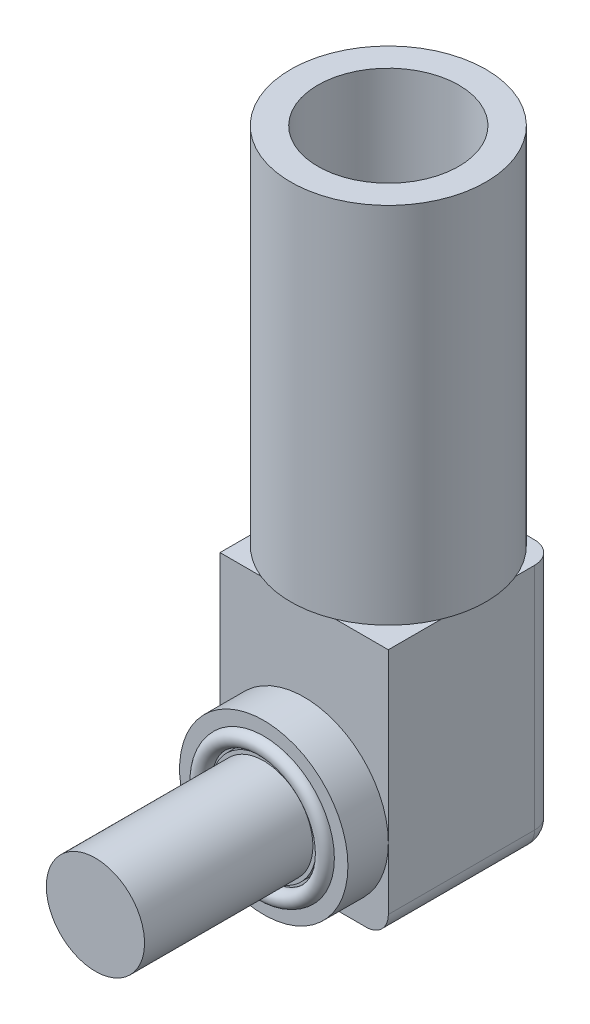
ISO-10303-21;
HEADER;
FILE_DESCRIPTION(('STEP AP214'),'2;1');
FILE_NAME('part.step','',(''),(''),'','','');
FILE_SCHEMA(('AUTOMOTIVE_DESIGN { 1 0 10303 214 1 1 1 1 }'));
ENDSEC;
DATA;
#1=APPLICATION_CONTEXT('core data for automotive mechanical design processes');
#2=APPLICATION_PROTOCOL_DEFINITION('international standard','automotive_design',2000,#1);
#3=PRODUCT_CONTEXT('',#1,'mechanical');
#4=PRODUCT('Part','Part','',(#3));
#5=PRODUCT_RELATED_PRODUCT_CATEGORY('part','',(#4));
#6=PRODUCT_DEFINITION_FORMATION('','',#4);
#7=PRODUCT_DEFINITION_CONTEXT('part definition',#1,'design');
#8=PRODUCT_DEFINITION('design','',#6,#7);
#9=PRODUCT_DEFINITION_SHAPE('','',#8);
#10=(LENGTH_UNIT() NAMED_UNIT(*) SI_UNIT(.MILLI.,.METRE.));
#11=(NAMED_UNIT(*) PLANE_ANGLE_UNIT() SI_UNIT($,.RADIAN.));
#12=(NAMED_UNIT(*) SI_UNIT($,.STERADIAN.) SOLID_ANGLE_UNIT());
#13=UNCERTAINTY_MEASURE_WITH_UNIT(LENGTH_MEASURE(1.E-05),#10,'distance_accuracy_value','');
#14=(GEOMETRIC_REPRESENTATION_CONTEXT(3) GLOBAL_UNCERTAINTY_ASSIGNED_CONTEXT((#13)) GLOBAL_UNIT_ASSIGNED_CONTEXT((#10,
#11,#12)) REPRESENTATION_CONTEXT('',''));
#15=CARTESIAN_POINT('',(0.,0.,0.));
#16=DIRECTION('',(0.,0.,1.));
#17=DIRECTION('',(1.,0.,0.));
#18=AXIS2_PLACEMENT_3D('',#15,#16,#17);
#19=CARTESIAN_POINT('',(11.049,70.284231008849,0.));
#20=DIRECTION('',(0.,1.,0.));
#21=DIRECTION('',(0.,0.,1.));
#22=AXIS2_PLACEMENT_3D('',#19,#20,#21);
#23=PLANE('',#22);
#24=CARTESIAN_POINT('',(0.,70.284231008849,0.));
#25=DIRECTION('',(0.,-1.,0.));
#26=DIRECTION('',(0.,0.,-1.));
#27=AXIS2_PLACEMENT_3D('',#24,#25,#26);
#28=CIRCLE('',#27,7.9756);
#29=CARTESIAN_POINT('',(0.,70.284231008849,-7.9756));
#30=VERTEX_POINT('',#29);
#31=EDGE_CURVE('E11',#30,#30,#28,.T.);
#32=ORIENTED_EDGE('',*,*,#31,.T.);
#33=EDGE_LOOP('',(#32));
#34=FACE_BOUND('',#33,.T.);
#35=CARTESIAN_POINT('',(0.,70.284231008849,0.));
#36=DIRECTION('',(0.,-1.,0.));
#37=DIRECTION('',(0.,0.,-1.));
#38=AXIS2_PLACEMENT_3D('',#35,#36,#37);
#39=CIRCLE('',#38,11.049);
#40=CARTESIAN_POINT('',(0.,70.284231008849,-11.049));
#41=VERTEX_POINT('',#40);
#42=EDGE_CURVE('E86',#41,#41,#39,.T.);
#43=ORIENTED_EDGE('',*,*,#42,.F.);
#44=EDGE_LOOP('',(#43));
#45=FACE_BOUND('',#44,.T.);
#46=ADVANCED_FACE('F46',(#34,#45),#23,.T.);
#47=CARTESIAN_POINT('',(0.,0.,0.));
#48=DIRECTION('',(0.,-1.,0.));
#49=DIRECTION('',(0.,0.,-1.));
#50=AXIS2_PLACEMENT_3D('',#47,#48,#49);
#51=CYLINDRICAL_SURFACE('',#50,7.9756);
#52=CARTESIAN_POINT('',(0.,38.4095812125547,0.));
#53=DIRECTION('',(0.,-1.,0.));
#54=DIRECTION('',(0.,0.,-1.));
#55=AXIS2_PLACEMENT_3D('',#52,#53,#54);
#56=CIRCLE('',#55,7.9756);
#57=CARTESIAN_POINT('',(0.,38.4095812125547,-7.9756));
#58=VERTEX_POINT('',#57);
#59=EDGE_CURVE('E52',#58,#58,#56,.T.);
#60=ORIENTED_EDGE('',*,*,#59,.T.);
#61=EDGE_LOOP('',(#60));
#62=FACE_BOUND('',#61,.T.);
#63=ORIENTED_EDGE('',*,*,#31,.F.);
#64=EDGE_LOOP('',(#63));
#65=FACE_BOUND('',#64,.T.);
#66=ADVANCED_FACE('F94',(#62,#65),#51,.F.);
#67=CARTESIAN_POINT('',(9.75575056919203,38.4095812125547,0.));
#68=DIRECTION('',(0.,-1.,0.));
#69=DIRECTION('',(0.,0.,-1.));
#70=AXIS2_PLACEMENT_3D('',#67,#68,#69);
#71=PLANE('',#70);
#72=CARTESIAN_POINT('',(0.,38.4095812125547,0.));
#73=DIRECTION('',(0.,-1.,0.));
#74=DIRECTION('',(0.,0.,-1.));
#75=AXIS2_PLACEMENT_3D('',#72,#73,#74);
#76=CIRCLE('',#75,9.75575056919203);
#77=CARTESIAN_POINT('',(0.,38.4095812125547,-9.75575056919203));
#78=VERTEX_POINT('',#77);
#79=EDGE_CURVE('E56',#78,#78,#76,.T.);
#80=ORIENTED_EDGE('',*,*,#79,.T.);
#81=EDGE_LOOP('',(#80));
#82=FACE_BOUND('',#81,.T.);
#83=ORIENTED_EDGE('',*,*,#59,.F.);
#84=EDGE_LOOP('',(#83));
#85=FACE_BOUND('',#84,.T.);
#86=ADVANCED_FACE('F98',(#82,#85),#71,.T.);
#87=CARTESIAN_POINT('',(0.,0.,0.));
#88=DIRECTION('',(0.,-1.,0.));
#89=DIRECTION('',(0.,0.,-1.));
#90=AXIS2_PLACEMENT_3D('',#87,#88,#89);
#91=CYLINDRICAL_SURFACE('',#90,9.75575056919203);
#92=CARTESIAN_POINT('',(0.,35.384631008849,0.));
#93=DIRECTION('',(0.,-1.,0.));
#94=DIRECTION('',(0.,0.,-1.));
#95=AXIS2_PLACEMENT_3D('',#92,#93,#94);
#96=CIRCLE('',#95,9.75575056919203);
#97=CARTESIAN_POINT('',(0.,35.384631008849,-9.75575056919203));
#98=VERTEX_POINT('',#97);
#99=EDGE_CURVE('E60',#98,#98,#96,.T.);
#100=ORIENTED_EDGE('',*,*,#99,.T.);
#101=EDGE_LOOP('',(#100));
#102=FACE_BOUND('',#101,.T.);
#103=ORIENTED_EDGE('',*,*,#79,.F.);
#104=EDGE_LOOP('',(#103));
#105=FACE_BOUND('',#104,.T.);
#106=ADVANCED_FACE('F102',(#102,#105),#91,.F.);
#107=CARTESIAN_POINT('',(9.75575056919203,35.384631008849,0.));
#108=DIRECTION('',(0.,1.,0.));
#109=DIRECTION('',(0.,0.,1.));
#110=AXIS2_PLACEMENT_3D('',#107,#108,#109);
#111=PLANE('',#110);
#112=CARTESIAN_POINT('',(0.,35.384631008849,0.));
#113=DIRECTION('',(0.,-1.,0.));
#114=DIRECTION('',(0.,0.,-1.));
#115=AXIS2_PLACEMENT_3D('',#112,#113,#114);
#116=CIRCLE('',#115,9.0805);
#117=CARTESIAN_POINT('',(0.,35.384631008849,-9.0805));
#118=VERTEX_POINT('',#117);
#119=EDGE_CURVE('E65',#118,#118,#116,.T.);
#120=ORIENTED_EDGE('',*,*,#119,.T.);
#121=EDGE_LOOP('',(#120));
#122=FACE_BOUND('',#121,.T.);
#123=ORIENTED_EDGE('',*,*,#99,.F.);
#124=EDGE_LOOP('',(#123));
#125=FACE_BOUND('',#124,.T.);
#126=ADVANCED_FACE('F109',(#122,#125),#111,.T.);
#127=CARTESIAN_POINT('',(0.,0.,0.));
#128=DIRECTION('',(0.,-1.,0.));
#129=DIRECTION('',(0.,0.,-1.));
#130=AXIS2_PLACEMENT_3D('',#127,#128,#129);
#131=CYLINDRICAL_SURFACE('',#130,9.0805);
#132=CARTESIAN_POINT('',(0.,33.860631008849,0.));
#133=DIRECTION('',(0.,-1.,0.));
#134=DIRECTION('',(0.,0.,-1.));
#135=AXIS2_PLACEMENT_3D('',#132,#133,#134);
#136=CIRCLE('',#135,9.0805);
#137=CARTESIAN_POINT('',(0.,33.860631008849,-9.0805));
#138=VERTEX_POINT('',#137);
#139=EDGE_CURVE('E68',#138,#138,#136,.T.);
#140=ORIENTED_EDGE('',*,*,#139,.T.);
#141=EDGE_LOOP('',(#140));
#142=FACE_BOUND('',#141,.T.);
#143=ORIENTED_EDGE('',*,*,#119,.F.);
#144=EDGE_LOOP('',(#143));
#145=FACE_BOUND('',#144,.T.);
#146=ADVANCED_FACE('F113',(#142,#145),#131,.F.);
#147=CARTESIAN_POINT('',(9.0805,33.860631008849,0.));
#148=DIRECTION('',(0.,-1.,0.));
#149=DIRECTION('',(0.,0.,-1.));
#150=AXIS2_PLACEMENT_3D('',#147,#148,#149);
#151=PLANE('',#150);
#152=CARTESIAN_POINT('',(0.,33.860631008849,0.));
#153=DIRECTION('',(0.,-1.,0.));
#154=DIRECTION('',(0.,0.,-1.));
#155=AXIS2_PLACEMENT_3D('',#152,#153,#154);
#156=CIRCLE('',#155,9.75575056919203);
#157=CARTESIAN_POINT('',(0.,33.860631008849,-9.75575056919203));
#158=VERTEX_POINT('',#157);
#159=EDGE_CURVE('E71',#158,#158,#156,.T.);
#160=ORIENTED_EDGE('',*,*,#159,.T.);
#161=EDGE_LOOP('',(#160));
#162=FACE_BOUND('',#161,.T.);
#163=ORIENTED_EDGE('',*,*,#139,.F.);
#164=EDGE_LOOP('',(#163));
#165=FACE_BOUND('',#164,.T.);
#166=ADVANCED_FACE('F117',(#162,#165),#151,.T.);
#167=CARTESIAN_POINT('',(0.,0.,0.));
#168=DIRECTION('',(0.,-1.,0.));
#169=DIRECTION('',(0.,0.,-1.));
#170=AXIS2_PLACEMENT_3D('',#167,#168,#169);
#171=CYLINDRICAL_SURFACE('',#170,9.75575056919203);
#172=CARTESIAN_POINT('',(0.,32.209631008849,0.));
#173=DIRECTION('',(0.,-1.,0.));
#174=DIRECTION('',(0.,0.,-1.));
#175=AXIS2_PLACEMENT_3D('',#172,#173,#174);
#176=CIRCLE('',#175,9.75575056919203);
#177=CARTESIAN_POINT('',(0.,32.209631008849,-9.75575056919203));
#178=VERTEX_POINT('',#177);
#179=EDGE_CURVE('E74',#178,#178,#176,.T.);
#180=ORIENTED_EDGE('',*,*,#179,.T.);
#181=EDGE_LOOP('',(#180));
#182=FACE_BOUND('',#181,.T.);
#183=ORIENTED_EDGE('',*,*,#159,.F.);
#184=EDGE_LOOP('',(#183));
#185=FACE_BOUND('',#184,.T.);
#186=ADVANCED_FACE('F121',(#182,#185),#171,.F.);
#187=CARTESIAN_POINT('',(9.75575056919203,32.209631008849,0.));
#188=DIRECTION('',(0.,1.,0.));
#189=DIRECTION('',(0.,0.,1.));
#190=AXIS2_PLACEMENT_3D('',#187,#188,#189);
#191=PLANE('',#190);
#192=CARTESIAN_POINT('',(0.,32.209631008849,0.));
#193=DIRECTION('',(0.,-1.,0.));
#194=DIRECTION('',(0.,0.,-1.));
#195=AXIS2_PLACEMENT_3D('',#192,#193,#194);
#196=CIRCLE('',#195,9.0805);
#197=CARTESIAN_POINT('',(0.,32.209631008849,-9.0805));
#198=VERTEX_POINT('',#197);
#199=EDGE_CURVE('E77',#198,#198,#196,.T.);
#200=ORIENTED_EDGE('',*,*,#199,.T.);
#201=EDGE_LOOP('',(#200));
#202=FACE_BOUND('',#201,.T.);
#203=ORIENTED_EDGE('',*,*,#179,.F.);
#204=EDGE_LOOP('',(#203));
#205=FACE_BOUND('',#204,.T.);
#206=ADVANCED_FACE('F125',(#202,#205),#191,.T.);
#207=CARTESIAN_POINT('',(0.,0.,0.));
#208=DIRECTION('',(0.,-1.,0.));
#209=DIRECTION('',(0.,0.,-1.));
#210=AXIS2_PLACEMENT_3D('',#207,#208,#209);
#211=CYLINDRICAL_SURFACE('',#210,9.0805);
#212=CARTESIAN_POINT('',(0.,29.136231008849,0.));
#213=DIRECTION('',(0.,-1.,0.));
#214=DIRECTION('',(0.,0.,-1.));
#215=AXIS2_PLACEMENT_3D('',#212,#213,#214);
#216=CIRCLE('',#215,9.0805);
#217=CARTESIAN_POINT('',(0.,29.136231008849,-9.0805));
#218=VERTEX_POINT('',#217);
#219=EDGE_CURVE('E80',#218,#218,#216,.T.);
#220=ORIENTED_EDGE('',*,*,#219,.T.);
#221=EDGE_LOOP('',(#220));
#222=FACE_BOUND('',#221,.T.);
#223=ORIENTED_EDGE('',*,*,#199,.F.);
#224=EDGE_LOOP('',(#223));
#225=FACE_BOUND('',#224,.T.);
#226=ADVANCED_FACE('F129',(#222,#225),#211,.F.);
#227=CARTESIAN_POINT('',(9.0805,29.136231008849,0.));
#228=DIRECTION('',(0.,-1.,0.));
#229=DIRECTION('',(0.,0.,-1.));
#230=AXIS2_PLACEMENT_3D('',#227,#228,#229);
#231=PLANE('',#230);
#232=CARTESIAN_POINT('',(0.,29.136231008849,0.));
#233=DIRECTION('',(0.,-1.,0.));
#234=DIRECTION('',(0.,0.,-1.));
#235=AXIS2_PLACEMENT_3D('',#232,#233,#234);
#236=CIRCLE('',#235,11.049);
#237=CARTESIAN_POINT('',(0.,29.136231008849,-11.049));
#238=VERTEX_POINT('',#237);
#239=EDGE_CURVE('E83',#238,#238,#236,.T.);
#240=ORIENTED_EDGE('',*,*,#239,.T.);
#241=EDGE_LOOP('',(#240));
#242=FACE_BOUND('',#241,.T.);
#243=ORIENTED_EDGE('',*,*,#219,.F.);
#244=EDGE_LOOP('',(#243));
#245=FACE_BOUND('',#244,.T.);
#246=ADVANCED_FACE('F133',(#242,#245),#231,.T.);
#247=CARTESIAN_POINT('',(0.,0.,0.));
#248=DIRECTION('',(0.,-1.,0.));
#249=DIRECTION('',(0.,0.,-1.));
#250=AXIS2_PLACEMENT_3D('',#247,#248,#249);
#251=CYLINDRICAL_SURFACE('',#250,11.049);
#252=ORIENTED_EDGE('',*,*,#42,.T.);
#253=EDGE_LOOP('',(#252));
#254=FACE_BOUND('',#253,.T.);
#255=ORIENTED_EDGE('',*,*,#239,.F.);
#256=EDGE_LOOP('',(#255));
#257=FACE_BOUND('',#256,.T.);
#258=ADVANCED_FACE('F90',(#254,#257),#251,.T.);
#259=CLOSED_SHELL('',(#46,#66,#86,#106,#126,#146,#166,#186,#206,#226,#246,#258));
#260=MANIFOLD_SOLID_BREP('B2',#259);
#261=CARTESIAN_POINT('',(0.,9.525,14.097));
#262=DIRECTION('',(0.,0.,1.));
#263=DIRECTION('',(1.,0.,0.));
#264=AXIS2_PLACEMENT_3D('',#261,#262,#263);
#265=PLANE('',#264);
#266=CARTESIAN_POINT('',(0.,9.525,14.097));
#267=DIRECTION('',(0.,0.,1.));
#268=DIRECTION('',(1.,0.,0.));
#269=AXIS2_PLACEMENT_3D('',#266,#267,#268);
#270=CIRCLE('',#269,9.525);
#271=CARTESIAN_POINT('',(9.525,9.525,14.097));
#272=VERTEX_POINT('',#271);
#273=EDGE_CURVE('E347',#272,#272,#270,.T.);
#274=ORIENTED_EDGE('',*,*,#273,.T.);
#275=EDGE_LOOP('',(#274));
#276=FACE_BOUND('',#275,.T.);
#277=CARTESIAN_POINT('',(0.,9.525,14.097));
#278=DIRECTION('',(0.,0.,1.));
#279=DIRECTION('',(1.,0.,0.));
#280=AXIS2_PLACEMENT_3D('',#277,#278,#279);
#281=CIRCLE('',#280,7.99);
#282=CARTESIAN_POINT('',(7.99,9.525,14.097));
#283=VERTEX_POINT('',#282);
#284=EDGE_CURVE('E540',#283,#283,#281,.F.);
#285=ORIENTED_EDGE('',*,*,#284,.T.);
#286=EDGE_LOOP('',(#285));
#287=FACE_BOUND('',#286,.T.);
#288=ADVANCED_FACE('F242',(#276,#287),#265,.T.);
#289=CARTESIAN_POINT('',(-9.525,28.448,9.525));
#290=DIRECTION('',(0.,0.,-1.));
#291=DIRECTION('',(-1.,0.,0.));
#292=AXIS2_PLACEMENT_3D('',#289,#290,#291);
#293=PLANE('',#292);
#294=CARTESIAN_POINT('',(0.,9.525,9.525));
#295=DIRECTION('',(0.,0.,1.));
#296=DIRECTION('',(1.,0.,0.));
#297=AXIS2_PLACEMENT_3D('',#294,#295,#296);
#298=CIRCLE('',#297,9.525);
#299=CARTESIAN_POINT('',(9.525,9.525,9.525));
#300=VERTEX_POINT('',#299);
#301=CARTESIAN_POINT('',(-9.525,9.525,9.525));
#302=VERTEX_POINT('',#301);
#303=EDGE_CURVE('E341',#300,#302,#298,.T.);
#304=ORIENTED_EDGE('',*,*,#303,.F.);
#305=DIRECTION('',(0.,-1.,0.));
#306=VECTOR('',#305,1.);
#307=CARTESIAN_POINT('',(9.525,28.448,9.525));
#308=LINE('',#307,#306);
#309=CARTESIAN_POINT('',(9.525,28.448,9.525));
#310=VERTEX_POINT('',#309);
#311=EDGE_CURVE('E316',#310,#300,#308,.T.);
#312=ORIENTED_EDGE('',*,*,#311,.F.);
#313=DIRECTION('',(1.,0.,0.));
#314=VECTOR('',#313,1.);
#315=CARTESIAN_POINT('',(-9.525,28.448,9.525));
#316=LINE('',#315,#314);
#317=CARTESIAN_POINT('',(-9.525,28.448,9.525));
#318=VERTEX_POINT('',#317);
#319=EDGE_CURVE('E471',#318,#310,#316,.T.);
#320=ORIENTED_EDGE('',*,*,#319,.F.);
#321=DIRECTION('',(0.,-1.,0.));
#322=VECTOR('',#321,1.);
#323=CARTESIAN_POINT('',(-9.525,28.448,9.525));
#324=LINE('',#323,#322);
#325=EDGE_CURVE('E344',#318,#302,#324,.T.);
#326=ORIENTED_EDGE('',*,*,#325,.T.);
#327=EDGE_LOOP('',(#304,#312,#320,#326));
#328=FACE_BOUND('',#327,.T.);
#329=ADVANCED_FACE('F342',(#328),#293,.F.);
#330=CARTESIAN_POINT('',(-9.525,2.5,9.525));
#331=VERTEX_POINT('',#330);
#332=EDGE_CURVE('E327',#302,#331,#324,.T.);
#333=ORIENTED_EDGE('',*,*,#332,.T.);
#334=CARTESIAN_POINT('',(-7.025,2.5,9.525));
#335=DIRECTION('',(0.,0.,-1.));
#336=DIRECTION('',(-1.,0.,0.));
#337=AXIS2_PLACEMENT_3D('',#334,#335,#336);
#338=CIRCLE('',#337,2.5);
#339=CARTESIAN_POINT('',(-7.025,0.,9.525));
#340=VERTEX_POINT('',#339);
#341=EDGE_CURVE('E501',#331,#340,#338,.F.);
#342=ORIENTED_EDGE('',*,*,#341,.T.);
#343=DIRECTION('',(1.,0.,0.));
#344=VECTOR('',#343,1.);
#345=CARTESIAN_POINT('',(-9.525,0.,9.525));
#346=LINE('',#345,#344);
#347=CARTESIAN_POINT('',(0.,0.,9.525));
#348=VERTEX_POINT('',#347);
#349=EDGE_CURVE('E467',#340,#348,#346,.T.);
#350=ORIENTED_EDGE('',*,*,#349,.T.);
#351=EDGE_CURVE('E350',#302,#348,#298,.T.);
#352=ORIENTED_EDGE('',*,*,#351,.F.);
#353=EDGE_LOOP('',(#333,#342,#350,#352));
#354=FACE_BOUND('',#353,.T.);
#355=ADVANCED_FACE('F588',(#354),#293,.F.);
#356=CARTESIAN_POINT('',(7.025,0.,9.525));
#357=VERTEX_POINT('',#356);
#358=EDGE_CURVE('E466',#348,#357,#346,.T.);
#359=ORIENTED_EDGE('',*,*,#358,.T.);
#360=CARTESIAN_POINT('',(7.025,2.5,9.525));
#361=DIRECTION('',(0.,0.,-1.));
#362=DIRECTION('',(-1.,0.,0.));
#363=AXIS2_PLACEMENT_3D('',#360,#361,#362);
#364=CIRCLE('',#363,2.5);
#365=CARTESIAN_POINT('',(9.525,2.5,9.525));
#366=VERTEX_POINT('',#365);
#367=EDGE_CURVE('E337',#357,#366,#364,.F.);
#368=ORIENTED_EDGE('',*,*,#367,.T.);
#369=EDGE_CURVE('E320',#300,#366,#308,.T.);
#370=ORIENTED_EDGE('',*,*,#369,.F.);
#371=EDGE_CURVE('E334',#348,#300,#298,.T.);
#372=ORIENTED_EDGE('',*,*,#371,.F.);
#373=EDGE_LOOP('',(#359,#368,#370,#372));
#374=FACE_BOUND('',#373,.T.);
#375=ADVANCED_FACE('F332',(#374),#293,.F.);
#376=CARTESIAN_POINT('',(0.,51.308,4.445));
#377=DIRECTION('',(0.,1.,0.));
#378=DIRECTION('',(-1.,0.,0.));
#379=AXIS2_PLACEMENT_3D('',#376,#377,#378);
#380=PLANE('',#379);
#381=CARTESIAN_POINT('',(0.,51.308,0.));
#382=DIRECTION('',(0.,1.,0.));
#383=DIRECTION('',(-1.,0.,0.));
#384=AXIS2_PLACEMENT_3D('',#381,#382,#383);
#385=CIRCLE('',#384,1.4605);
#386=CARTESIAN_POINT('',(-1.46050000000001,51.308,0.));
#387=VERTEX_POINT('',#386);
#388=EDGE_CURVE('E370',#387,#387,#385,.T.);
#389=ORIENTED_EDGE('',*,*,#388,.T.);
#390=EDGE_LOOP('',(#389));
#391=FACE_BOUND('',#390,.T.);
#392=CARTESIAN_POINT('',(0.,51.308,0.));
#393=DIRECTION('',(0.,1.,0.));
#394=DIRECTION('',(-1.,0.,0.));
#395=AXIS2_PLACEMENT_3D('',#392,#393,#394);
#396=CIRCLE('',#395,0.9906);
#397=CARTESIAN_POINT('',(0.990599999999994,51.308,0.));
#398=VERTEX_POINT('',#397);
#399=EDGE_CURVE('E361',#398,#398,#396,.T.);
#400=ORIENTED_EDGE('',*,*,#399,.F.);
#401=EDGE_LOOP('',(#400));
#402=FACE_BOUND('',#401,.T.);
#403=ADVANCED_FACE('F739',(#391,#402),#380,.T.);
#404=CARTESIAN_POINT('',(0.,41.656,0.));
#405=DIRECTION('',(0.,1.,0.));
#406=DIRECTION('',(-1.,0.,0.));
#407=AXIS2_PLACEMENT_3D('',#404,#405,#406);
#408=PLANE('',#407);
#409=CARTESIAN_POINT('',(3.84948291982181,41.656,2.22250000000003));
#410=DIRECTION('',(0.,1.,0.));
#411=DIRECTION('',(-0.500000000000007,0.,0.866025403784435));
#412=AXIS2_PLACEMENT_3D('',#409,#410,#411);
#413=CIRCLE('',#412,1.4605);
#414=CARTESIAN_POINT('',(3.1192329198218,41.656,3.4873301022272));
#415=VERTEX_POINT('',#414);
#416=EDGE_CURVE('E397',#415,#415,#413,.T.);
#417=ORIENTED_EDGE('',*,*,#416,.F.);
#418=EDGE_LOOP('',(#417));
#419=FACE_BOUND('',#418,.T.);
#420=CARTESIAN_POINT('',(-3.84948291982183,41.656,-2.22250000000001));
#421=DIRECTION('',(0.,1.,0.));
#422=DIRECTION('',(0.500000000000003,0.,-0.866025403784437));
#423=AXIS2_PLACEMENT_3D('',#420,#421,#422);
#424=CIRCLE('',#423,1.4605);
#425=CARTESIAN_POINT('',(-3.11923291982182,41.656,-3.48733010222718));
#426=VERTEX_POINT('',#425);
#427=EDGE_CURVE('E409',#426,#426,#424,.T.);
#428=ORIENTED_EDGE('',*,*,#427,.F.);
#429=EDGE_LOOP('',(#428));
#430=FACE_BOUND('',#429,.T.);
#431=CARTESIAN_POINT('',(0.,41.656,4.445));
#432=DIRECTION('',(0.,1.,0.));
#433=DIRECTION('',(-1.,0.,0.));
#434=AXIS2_PLACEMENT_3D('',#431,#432,#433);
#435=CIRCLE('',#434,1.4605);
#436=CARTESIAN_POINT('',(-1.46050000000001,41.656,4.445));
#437=VERTEX_POINT('',#436);
#438=EDGE_CURVE('E427',#437,#437,#435,.T.);
#439=ORIENTED_EDGE('',*,*,#438,.F.);
#440=EDGE_LOOP('',(#439));
#441=FACE_BOUND('',#440,.T.);
#442=CARTESIAN_POINT('',(0.,41.656,0.));
#443=DIRECTION('',(0.,1.,0.));
#444=DIRECTION('',(-1.,0.,0.));
#445=AXIS2_PLACEMENT_3D('',#442,#443,#444);
#446=CIRCLE('',#445,7.874);
#447=CARTESIAN_POINT('',(-7.874,41.656,0.));
#448=VERTEX_POINT('',#447);
#449=EDGE_CURVE('E433',#448,#448,#446,.T.);
#450=ORIENTED_EDGE('',*,*,#449,.T.);
#451=EDGE_LOOP('',(#450));
#452=FACE_BOUND('',#451,.T.);
#453=CARTESIAN_POINT('',(-3.84948291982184,41.656,2.22249999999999));
#454=DIRECTION('',(0.,1.,0.));
#455=DIRECTION('',(-0.499999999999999,0.,-0.866025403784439));
#456=AXIS2_PLACEMENT_3D('',#453,#454,#455);
#457=CIRCLE('',#456,1.4605);
#458=CARTESIAN_POINT('',(-4.57973291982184,41.656,0.957669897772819));
#459=VERTEX_POINT('',#458);
#460=EDGE_CURVE('E415',#459,#459,#457,.T.);
#461=ORIENTED_EDGE('',*,*,#460,.F.);
#462=EDGE_LOOP('',(#461));
#463=FACE_BOUND('',#462,.T.);
#464=CARTESIAN_POINT('',(3.84948291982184,41.656,-2.22249999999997));
#465=DIRECTION('',(0.,1.,0.));
#466=DIRECTION('',(0.499999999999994,0.,0.866025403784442));
#467=AXIS2_PLACEMENT_3D('',#464,#465,#466);
#468=CIRCLE('',#467,1.4605);
#469=CARTESIAN_POINT('',(4.57973291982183,41.656,-0.957669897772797));
#470=VERTEX_POINT('',#469);
#471=EDGE_CURVE('E403',#470,#470,#468,.T.);
#472=ORIENTED_EDGE('',*,*,#471,.F.);
#473=EDGE_LOOP('',(#472));
#474=FACE_BOUND('',#473,.T.);
#475=CARTESIAN_POINT('',(0.,41.656,0.));
#476=DIRECTION('',(0.,1.,0.));
#477=DIRECTION('',(-1.,0.,0.));
#478=AXIS2_PLACEMENT_3D('',#475,#476,#477);
#479=CIRCLE('',#478,1.4605);
#480=CARTESIAN_POINT('',(-1.46050000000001,41.656,0.));
#481=VERTEX_POINT('',#480);
#482=EDGE_CURVE('E367',#481,#481,#479,.T.);
#483=ORIENTED_EDGE('',*,*,#482,.F.);
#484=EDGE_LOOP('',(#483));
#485=FACE_BOUND('',#484,.T.);
#486=ADVANCED_FACE('F764',(#419,#430,#441,#452,#463,#474,#485),#408,.T.);
#487=CARTESIAN_POINT('',(3.8494829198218,51.308,2.22250000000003));
#488=DIRECTION('',(0.,1.,0.));
#489=DIRECTION('',(-0.500000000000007,0.,0.866025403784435));
#490=AXIS2_PLACEMENT_3D('',#487,#488,#489);
#491=PLANE('',#490);
#492=CARTESIAN_POINT('',(3.8494829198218,51.308,2.22250000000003));
#493=DIRECTION('',(0.,1.,0.));
#494=DIRECTION('',(-0.500000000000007,0.,0.866025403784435));
#495=AXIS2_PLACEMENT_3D('',#492,#493,#494);
#496=CIRCLE('',#495,1.4605);
#497=CARTESIAN_POINT('',(3.11923291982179,51.308,3.4873301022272));
#498=VERTEX_POINT('',#497);
#499=EDGE_CURVE('E400',#498,#498,#496,.T.);
#500=ORIENTED_EDGE('',*,*,#499,.T.);
#501=EDGE_LOOP('',(#500));
#502=FACE_BOUND('',#501,.T.);
#503=CARTESIAN_POINT('',(3.84948291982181,51.308,2.22250000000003));
#504=DIRECTION('',(0.,1.,0.));
#505=DIRECTION('',(-0.500000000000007,0.,0.866025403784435));
#506=AXIS2_PLACEMENT_3D('',#503,#504,#505);
#507=CIRCLE('',#506,0.9906);
#508=CARTESIAN_POINT('',(3.3541829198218,51.308,3.08038476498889));
#509=VERTEX_POINT('',#508);
#510=EDGE_CURVE('E373',#509,#509,#507,.T.);
#511=ORIENTED_EDGE('',*,*,#510,.F.);
#512=EDGE_LOOP('',(#511));
#513=FACE_BOUND('',#512,.T.);
#514=ADVANCED_FACE('F782',(#502,#513),#491,.T.);
#515=CARTESIAN_POINT('',(3.84948291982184,51.308,-2.22249999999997));
#516=DIRECTION('',(0.,1.,0.));
#517=DIRECTION('',(0.499999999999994,0.,0.866025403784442));
#518=AXIS2_PLACEMENT_3D('',#515,#516,#517);
#519=PLANE('',#518);
#520=CARTESIAN_POINT('',(3.84948291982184,51.308,-2.22249999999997));
#521=DIRECTION('',(0.,1.,0.));
#522=DIRECTION('',(0.499999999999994,0.,0.866025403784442));
#523=AXIS2_PLACEMENT_3D('',#520,#521,#522);
#524=CIRCLE('',#523,1.4605);
#525=CARTESIAN_POINT('',(4.57973291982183,51.308,-0.957669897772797));
#526=VERTEX_POINT('',#525);
#527=EDGE_CURVE('E406',#526,#526,#524,.T.);
#528=ORIENTED_EDGE('',*,*,#527,.T.);
#529=EDGE_LOOP('',(#528));
#530=FACE_BOUND('',#529,.T.);
#531=CARTESIAN_POINT('',(3.84948291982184,51.308,-2.22249999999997));
#532=DIRECTION('',(0.,1.,0.));
#533=DIRECTION('',(0.499999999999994,0.,0.866025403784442));
#534=AXIS2_PLACEMENT_3D('',#531,#532,#533);
#535=CIRCLE('',#534,0.9906);
#536=CARTESIAN_POINT('',(4.34478291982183,51.308,-1.36461523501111));
#537=VERTEX_POINT('',#536);
#538=EDGE_CURVE('E379',#537,#537,#535,.T.);
#539=ORIENTED_EDGE('',*,*,#538,.F.);
#540=EDGE_LOOP('',(#539));
#541=FACE_BOUND('',#540,.T.);
#542=ADVANCED_FACE('F872',(#530,#541),#519,.T.);
#543=CARTESIAN_POINT('',(-3.84948291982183,51.308,-2.22250000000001));
#544=DIRECTION('',(0.,1.,0.));
#545=DIRECTION('',(0.500000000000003,0.,-0.866025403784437));
#546=AXIS2_PLACEMENT_3D('',#543,#544,#545);
#547=PLANE('',#546);
#548=CARTESIAN_POINT('',(-3.84948291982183,51.308,-2.22250000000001));
#549=DIRECTION('',(0.,1.,0.));
#550=DIRECTION('',(0.500000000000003,0.,-0.866025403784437));
#551=AXIS2_PLACEMENT_3D('',#548,#549,#550);
#552=CIRCLE('',#551,1.4605);
#553=CARTESIAN_POINT('',(-3.11923291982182,51.308,-3.48733010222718));
#554=VERTEX_POINT('',#553);
#555=EDGE_CURVE('E412',#554,#554,#552,.T.);
#556=ORIENTED_EDGE('',*,*,#555,.T.);
#557=EDGE_LOOP('',(#556));
#558=FACE_BOUND('',#557,.T.);
#559=CARTESIAN_POINT('',(-3.84948291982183,51.308,-2.22250000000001));
#560=DIRECTION('',(0.,1.,0.));
#561=DIRECTION('',(0.500000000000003,0.,-0.866025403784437));
#562=AXIS2_PLACEMENT_3D('',#559,#560,#561);
#563=CIRCLE('',#562,0.9906);
#564=CARTESIAN_POINT('',(-3.35418291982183,51.308,-3.08038476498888));
#565=VERTEX_POINT('',#564);
#566=EDGE_CURVE('E385',#565,#565,#563,.T.);
#567=ORIENTED_EDGE('',*,*,#566,.F.);
#568=EDGE_LOOP('',(#567));
#569=FACE_BOUND('',#568,.T.);
#570=ADVANCED_FACE('F882',(#558,#569),#547,.T.);
#571=CARTESIAN_POINT('',(-3.84948291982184,51.308,2.22249999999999));
#572=DIRECTION('',(0.,1.,0.));
#573=DIRECTION('',(-0.499999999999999,0.,-0.866025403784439));
#574=AXIS2_PLACEMENT_3D('',#571,#572,#573);
#575=PLANE('',#574);
#576=CARTESIAN_POINT('',(-3.84948291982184,51.308,2.22249999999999));
#577=DIRECTION('',(0.,1.,0.));
#578=DIRECTION('',(-0.499999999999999,0.,-0.866025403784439));
#579=AXIS2_PLACEMENT_3D('',#576,#577,#578);
#580=CIRCLE('',#579,1.4605);
#581=CARTESIAN_POINT('',(-4.57973291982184,51.308,0.957669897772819));
#582=VERTEX_POINT('',#581);
#583=EDGE_CURVE('E418',#582,#582,#580,.T.);
#584=ORIENTED_EDGE('',*,*,#583,.T.);
#585=EDGE_LOOP('',(#584));
#586=FACE_BOUND('',#585,.T.);
#587=CARTESIAN_POINT('',(-3.84948291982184,51.308,2.22249999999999));
#588=DIRECTION('',(0.,1.,0.));
#589=DIRECTION('',(-0.499999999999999,0.,-0.866025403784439));
#590=AXIS2_PLACEMENT_3D('',#587,#588,#589);
#591=CIRCLE('',#590,0.9906);
#592=CARTESIAN_POINT('',(-4.34478291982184,51.308,1.36461523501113));
#593=VERTEX_POINT('',#592);
#594=EDGE_CURVE('E391',#593,#593,#591,.T.);
#595=ORIENTED_EDGE('',*,*,#594,.F.);
#596=EDGE_LOOP('',(#595));
#597=FACE_BOUND('',#596,.T.);
#598=ADVANCED_FACE('F891',(#586,#597),#575,.T.);
#599=CARTESIAN_POINT('',(0.,51.308,4.445));
#600=DIRECTION('',(0.,1.,0.));
#601=DIRECTION('',(-1.,0.,0.));
#602=AXIS2_PLACEMENT_3D('',#599,#600,#601);
#603=PLANE('',#602);
#604=CARTESIAN_POINT('',(0.,51.308,4.445));
#605=DIRECTION('',(0.,1.,0.));
#606=DIRECTION('',(-1.,0.,0.));
#607=AXIS2_PLACEMENT_3D('',#604,#605,#606);
#608=CIRCLE('',#607,1.4605);
#609=CARTESIAN_POINT('',(-1.46050000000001,51.308,4.445));
#610=VERTEX_POINT('',#609);
#611=EDGE_CURVE('E430',#610,#610,#608,.T.);
#612=ORIENTED_EDGE('',*,*,#611,.T.);
#613=EDGE_LOOP('',(#612));
#614=FACE_BOUND('',#613,.T.);
#615=CARTESIAN_POINT('',(0.,51.308,4.445));
#616=DIRECTION('',(0.,1.,0.));
#617=DIRECTION('',(-1.,0.,0.));
#618=AXIS2_PLACEMENT_3D('',#615,#616,#617);
#619=CIRCLE('',#618,0.9906);
#620=CARTESIAN_POINT('',(-0.990600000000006,51.308,4.445));
#621=VERTEX_POINT('',#620);
#622=EDGE_CURVE('E421',#621,#621,#619,.T.);
#623=ORIENTED_EDGE('',*,*,#622,.F.);
#624=EDGE_LOOP('',(#623));
#625=FACE_BOUND('',#624,.T.);
#626=ADVANCED_FACE('F900',(#614,#625),#603,.T.);
#627=CARTESIAN_POINT('',(8.8011,37.846,0.));
#628=DIRECTION('',(0.,-1.,0.));
#629=DIRECTION('',(1.,0.,0.));
#630=AXIS2_PLACEMENT_3D('',#627,#628,#629);
#631=PLANE('',#630);
#632=CARTESIAN_POINT('',(0.,37.846,0.));
#633=DIRECTION('',(0.,1.,0.));
#634=DIRECTION('',(-1.,0.,0.));
#635=AXIS2_PLACEMENT_3D('',#632,#633,#634);
#636=CIRCLE('',#635,8.8011);
#637=CARTESIAN_POINT('',(-8.80110000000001,37.846,0.));
#638=VERTEX_POINT('',#637);
#639=EDGE_CURVE('E463',#638,#638,#636,.T.);
#640=ORIENTED_EDGE('',*,*,#639,.T.);
#641=EDGE_LOOP('',(#640));
#642=FACE_BOUND('',#641,.T.);
#643=CARTESIAN_POINT('',(0.,37.846,0.));
#644=DIRECTION('',(0.,-1.,0.));
#645=DIRECTION('',(1.,0.,0.));
#646=AXIS2_PLACEMENT_3D('',#643,#644,#645);
#647=CIRCLE('',#646,7.874);
#648=CARTESIAN_POINT('',(7.87399999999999,37.846,0.));
#649=VERTEX_POINT('',#648);
#650=EDGE_CURVE('E352',#649,#649,#647,.F.);
#651=ORIENTED_EDGE('',*,*,#650,.F.);
#652=EDGE_LOOP('',(#651));
#653=FACE_BOUND('',#652,.T.);
#654=ADVANCED_FACE('F961',(#642,#653),#631,.F.);
#655=CARTESIAN_POINT('',(-9.525,28.448,-9.525));
#656=DIRECTION('',(0.,1.,0.));
#657=DIRECTION('',(0.,0.,1.));
#658=AXIS2_PLACEMENT_3D('',#655,#656,#657);
#659=PLANE('',#658);
#660=DIRECTION('',(-1.,0.,0.));
#661=VECTOR('',#660,1.);
#662=CARTESIAN_POINT('',(-9.525,28.448,-9.525));
#663=LINE('',#662,#661);
#664=CARTESIAN_POINT('',(7.02499999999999,28.448,-9.525));
#665=VERTEX_POINT('',#664);
#666=CARTESIAN_POINT('',(-7.025,28.448,-9.525));
#667=VERTEX_POINT('',#666);
#668=EDGE_CURVE('E338',#665,#667,#663,.T.);
#669=ORIENTED_EDGE('',*,*,#668,.T.);
#670=CARTESIAN_POINT('',(-7.025,28.448,-7.025));
#671=DIRECTION('',(0.,1.,0.));
#672=DIRECTION('',(0.,0.,1.));
#673=AXIS2_PLACEMENT_3D('',#670,#671,#672);
#674=CIRCLE('',#673,2.5);
#675=CARTESIAN_POINT('',(-9.525,28.448,-7.025));
#676=VERTEX_POINT('',#675);
#677=EDGE_CURVE('E44',#667,#676,#674,.T.);
#678=ORIENTED_EDGE('',*,*,#677,.T.);
#679=DIRECTION('',(0.,0.,1.));
#680=VECTOR('',#679,1.);
#681=CARTESIAN_POINT('',(-9.525,28.448,-9.525));
#682=LINE('',#681,#680);
#683=EDGE_CURVE('E469',#676,#318,#682,.T.);
#684=ORIENTED_EDGE('',*,*,#683,.T.);
#685=ORIENTED_EDGE('',*,*,#319,.T.);
#686=DIRECTION('',(0.,0.,-1.));
#687=VECTOR('',#686,1.);
#688=CARTESIAN_POINT('',(9.525,28.448,-9.525));
#689=LINE('',#688,#687);
#690=CARTESIAN_POINT('',(9.525,28.448,-7.025));
#691=VERTEX_POINT('',#690);
#692=EDGE_CURVE('E323',#310,#691,#689,.T.);
#693=ORIENTED_EDGE('',*,*,#692,.T.);
#694=CARTESIAN_POINT('',(7.025,28.448,-7.025));
#695=DIRECTION('',(0.,1.,0.));
#696=DIRECTION('',(0.,0.,1.));
#697=AXIS2_PLACEMENT_3D('',#694,#695,#696);
#698=CIRCLE('',#697,2.5);
#699=EDGE_CURVE('E250',#691,#665,#698,.T.);
#700=ORIENTED_EDGE('',*,*,#699,.T.);
#701=EDGE_LOOP('',(#669,#678,#684,#685,#693,#700));
#702=FACE_BOUND('',#701,.T.);
#703=CARTESIAN_POINT('',(0.,28.448,0.));
#704=DIRECTION('',(0.,1.,0.));
#705=DIRECTION('',(-1.,0.,0.));
#706=AXIS2_PLACEMENT_3D('',#703,#704,#705);
#707=CIRCLE('',#706,8.8011);
#708=CARTESIAN_POINT('',(-8.80110000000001,28.448,0.));
#709=VERTEX_POINT('',#708);
#710=EDGE_CURVE('E436',#709,#709,#707,.T.);
#711=ORIENTED_EDGE('',*,*,#710,.F.);
#712=EDGE_LOOP('',(#711));
#713=FACE_BOUND('',#712,.T.);
#714=ADVANCED_FACE('F504',(#702,#713),#659,.T.);
#715=CARTESIAN_POINT('',(-9.525,28.448,-9.525));
#716=DIRECTION('',(1.,0.,0.));
#717=DIRECTION('',(0.,0.,-1.));
#718=AXIS2_PLACEMENT_3D('',#715,#716,#717);
#719=PLANE('',#718);
#720=DIRECTION('',(0.,-1.,0.));
#721=VECTOR('',#720,1.);
#722=CARTESIAN_POINT('',(-9.525,28.448,-7.025));
#723=LINE('',#722,#721);
#724=CARTESIAN_POINT('',(-9.525,2.5,-7.025));
#725=VERTEX_POINT('',#724);
#726=EDGE_CURVE('E257',#676,#725,#723,.T.);
#727=ORIENTED_EDGE('',*,*,#726,.T.);
#728=DIRECTION('',(0.,0.,1.));
#729=VECTOR('',#728,1.);
#730=CARTESIAN_POINT('',(-9.525,2.5,-9.525));
#731=LINE('',#730,#729);
#732=EDGE_CURVE('E499',#725,#331,#731,.T.);
#733=ORIENTED_EDGE('',*,*,#732,.T.);
#734=ORIENTED_EDGE('',*,*,#332,.F.);
#735=ORIENTED_EDGE('',*,*,#325,.F.);
#736=ORIENTED_EDGE('',*,*,#683,.F.);
#737=EDGE_LOOP('',(#727,#733,#734,#735,#736));
#738=FACE_BOUND('',#737,.T.);
#739=ADVANCED_FACE('F244',(#738),#719,.F.);
#740=CARTESIAN_POINT('',(9.525,28.448,-9.525));
#741=DIRECTION('',(-1.,0.,0.));
#742=DIRECTION('',(0.,0.,1.));
#743=AXIS2_PLACEMENT_3D('',#740,#741,#742);
#744=PLANE('',#743);
#745=ORIENTED_EDGE('',*,*,#369,.T.);
#746=DIRECTION('',(0.,0.,-1.));
#747=VECTOR('',#746,1.);
#748=CARTESIAN_POINT('',(9.525,2.5,-9.525));
#749=LINE('',#748,#747);
#750=CARTESIAN_POINT('',(9.525,2.5,-7.025));
#751=VERTEX_POINT('',#750);
#752=EDGE_CURVE('E483',#366,#751,#749,.T.);
#753=ORIENTED_EDGE('',*,*,#752,.T.);
#754=DIRECTION('',(0.,-1.,0.));
#755=VECTOR('',#754,1.);
#756=CARTESIAN_POINT('',(9.525,28.448,-7.025));
#757=LINE('',#756,#755);
#758=EDGE_CURVE('E481',#751,#691,#757,.F.);
#759=ORIENTED_EDGE('',*,*,#758,.T.);
#760=ORIENTED_EDGE('',*,*,#692,.F.);
#761=ORIENTED_EDGE('',*,*,#311,.T.);
#762=EDGE_LOOP('',(#745,#753,#759,#760,#761));
#763=FACE_BOUND('',#762,.T.);
#764=ADVANCED_FACE('F318',(#763),#744,.F.);
#765=CARTESIAN_POINT('',(-9.525,28.448,-9.525));
#766=DIRECTION('',(0.,0.,1.));
#767=DIRECTION('',(1.,0.,0.));
#768=AXIS2_PLACEMENT_3D('',#765,#766,#767);
#769=PLANE('',#768);
#770=DIRECTION('',(-1.,0.,0.));
#771=VECTOR('',#770,1.);
#772=CARTESIAN_POINT('',(-9.525,2.5,-9.525));
#773=LINE('',#772,#771);
#774=CARTESIAN_POINT('',(7.025,2.5,-9.525));
#775=VERTEX_POINT('',#774);
#776=CARTESIAN_POINT('',(-7.025,2.5,-9.525));
#777=VERTEX_POINT('',#776);
#778=EDGE_CURVE('E494',#775,#777,#773,.T.);
#779=ORIENTED_EDGE('',*,*,#778,.T.);
#780=DIRECTION('',(0.,-1.,0.));
#781=VECTOR('',#780,1.);
#782=CARTESIAN_POINT('',(-7.025,28.448,-9.525));
#783=LINE('',#782,#781);
#784=EDGE_CURVE('E496',#777,#667,#783,.F.);
#785=ORIENTED_EDGE('',*,*,#784,.T.);
#786=ORIENTED_EDGE('',*,*,#668,.F.);
#787=DIRECTION('',(0.,-1.,0.));
#788=VECTOR('',#787,1.);
#789=CARTESIAN_POINT('',(7.025,28.448,-9.525));
#790=LINE('',#789,#788);
#791=EDGE_CURVE('E492',#665,#775,#790,.T.);
#792=ORIENTED_EDGE('',*,*,#791,.T.);
#793=EDGE_LOOP('',(#779,#785,#786,#792));
#794=FACE_BOUND('',#793,.T.);
#795=ADVANCED_FACE('F510',(#794),#769,.F.);
#796=CARTESIAN_POINT('',(-9.525,0.,-9.525));
#797=DIRECTION('',(0.,1.,0.));
#798=DIRECTION('',(0.,0.,1.));
#799=AXIS2_PLACEMENT_3D('',#796,#797,#798);
#800=PLANE('',#799);
#801=DIRECTION('',(-1.,0.,0.));
#802=VECTOR('',#801,1.);
#803=CARTESIAN_POINT('',(-9.525,0.,-7.025));
#804=LINE('',#803,#802);
#805=CARTESIAN_POINT('',(-7.025,0.,-7.025));
#806=VERTEX_POINT('',#805);
#807=CARTESIAN_POINT('',(7.025,0.,-7.025));
#808=VERTEX_POINT('',#807);
#809=EDGE_CURVE('E487',#806,#808,#804,.F.);
#810=ORIENTED_EDGE('',*,*,#809,.T.);
#811=DIRECTION('',(0.,0.,-1.));
#812=VECTOR('',#811,1.);
#813=CARTESIAN_POINT('',(7.025,0.,-9.52500000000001));
#814=LINE('',#813,#812);
#815=EDGE_CURVE('E489',#808,#357,#814,.F.);
#816=ORIENTED_EDGE('',*,*,#815,.T.);
#817=ORIENTED_EDGE('',*,*,#358,.F.);
#818=ORIENTED_EDGE('',*,*,#349,.F.);
#819=DIRECTION('',(0.,0.,1.));
#820=VECTOR('',#819,1.);
#821=CARTESIAN_POINT('',(-7.025,0.,-9.525));
#822=LINE('',#821,#820);
#823=EDGE_CURVE('E485',#340,#806,#822,.F.);
#824=ORIENTED_EDGE('',*,*,#823,.T.);
#825=EDGE_LOOP('',(#810,#816,#817,#818,#824));
#826=FACE_BOUND('',#825,.T.);
#827=ADVANCED_FACE('F1068',(#826),#800,.F.);
#828=CARTESIAN_POINT('',(0.,0.,0.));
#829=DIRECTION('',(0.,1.,0.));
#830=DIRECTION('',(-1.,0.,0.));
#831=AXIS2_PLACEMENT_3D('',#828,#829,#830);
#832=CYLINDRICAL_SURFACE('',#831,8.8011);
#833=ORIENTED_EDGE('',*,*,#639,.F.);
#834=EDGE_LOOP('',(#833));
#835=FACE_BOUND('',#834,.T.);
#836=CARTESIAN_POINT('',(0.,37.0332,0.));
#837=DIRECTION('',(0.,1.,0.));
#838=DIRECTION('',(-1.,0.,0.));
#839=AXIS2_PLACEMENT_3D('',#836,#837,#838);
#840=CIRCLE('',#839,8.8011);
#841=CARTESIAN_POINT('',(-8.80110000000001,37.0332,0.));
#842=VERTEX_POINT('',#841);
#843=EDGE_CURVE('E460',#842,#842,#840,.T.);
#844=ORIENTED_EDGE('',*,*,#843,.T.);
#845=EDGE_LOOP('',(#844));
#846=FACE_BOUND('',#845,.T.);
#847=ADVANCED_FACE('F1059',(#835,#846),#832,.T.);
#848=CARTESIAN_POINT('',(9.398,37.0332,0.));
#849=DIRECTION('',(0.,-1.,0.));
#850=DIRECTION('',(1.,0.,0.));
#851=AXIS2_PLACEMENT_3D('',#848,#849,#850);
#852=PLANE('',#851);
#853=ORIENTED_EDGE('',*,*,#843,.F.);
#854=EDGE_LOOP('',(#853));
#855=FACE_BOUND('',#854,.T.);
#856=CARTESIAN_POINT('',(0.,37.0332,0.));
#857=DIRECTION('',(0.,1.,0.));
#858=DIRECTION('',(-1.,0.,0.));
#859=AXIS2_PLACEMENT_3D('',#856,#857,#858);
#860=CIRCLE('',#859,9.398);
#861=CARTESIAN_POINT('',(-9.39800000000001,37.0332,0.));
#862=VERTEX_POINT('',#861);
#863=EDGE_CURVE('E457',#862,#862,#860,.T.);
#864=ORIENTED_EDGE('',*,*,#863,.T.);
#865=EDGE_LOOP('',(#864));
#866=FACE_BOUND('',#865,.T.);
#867=ADVANCED_FACE('F1050',(#855,#866),#852,.F.);
#868=CARTESIAN_POINT('',(0.,0.,0.));
#869=DIRECTION('',(0.,1.,0.));
#870=DIRECTION('',(-1.,0.,0.));
#871=AXIS2_PLACEMENT_3D('',#868,#869,#870);
#872=CYLINDRICAL_SURFACE('',#871,9.398);
#873=ORIENTED_EDGE('',*,*,#863,.F.);
#874=EDGE_LOOP('',(#873));
#875=FACE_BOUND('',#874,.T.);
#876=CARTESIAN_POINT('',(0.,35.4584000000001,0.));
#877=DIRECTION('',(0.,1.,0.));
#878=DIRECTION('',(-1.,0.,0.));
#879=AXIS2_PLACEMENT_3D('',#876,#877,#878);
#880=CIRCLE('',#879,9.398);
#881=CARTESIAN_POINT('',(-9.39800000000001,35.4584000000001,0.));
#882=VERTEX_POINT('',#881);
#883=EDGE_CURVE('E454',#882,#882,#880,.T.);
#884=ORIENTED_EDGE('',*,*,#883,.T.);
#885=EDGE_LOOP('',(#884));
#886=FACE_BOUND('',#885,.T.);
#887=ADVANCED_FACE('F1041',(#875,#886),#872,.T.);
#888=CARTESIAN_POINT('',(8.8011,35.4584000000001,0.));
#889=DIRECTION('',(0.,1.,0.));
#890=DIRECTION('',(-1.,0.,0.));
#891=AXIS2_PLACEMENT_3D('',#888,#889,#890);
#892=PLANE('',#891);
#893=ORIENTED_EDGE('',*,*,#883,.F.);
#894=EDGE_LOOP('',(#893));
#895=FACE_BOUND('',#894,.T.);
#896=CARTESIAN_POINT('',(0.,35.4584000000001,0.));
#897=DIRECTION('',(0.,1.,0.));
#898=DIRECTION('',(-1.,0.,0.));
#899=AXIS2_PLACEMENT_3D('',#896,#897,#898);
#900=CIRCLE('',#899,8.8011);
#901=CARTESIAN_POINT('',(-8.80110000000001,35.4584000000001,0.));
#902=VERTEX_POINT('',#901);
#903=EDGE_CURVE('E451',#902,#902,#900,.T.);
#904=ORIENTED_EDGE('',*,*,#903,.T.);
#905=EDGE_LOOP('',(#904));
#906=FACE_BOUND('',#905,.T.);
#907=ADVANCED_FACE('F1032',(#895,#906),#892,.F.);
#908=CARTESIAN_POINT('',(0.,0.,0.));
#909=DIRECTION('',(0.,1.,0.));
#910=DIRECTION('',(-1.,0.,0.));
#911=AXIS2_PLACEMENT_3D('',#908,#909,#910);
#912=CYLINDRICAL_SURFACE('',#911,8.8011);
#913=ORIENTED_EDGE('',*,*,#903,.F.);
#914=EDGE_LOOP('',(#913));
#915=FACE_BOUND('',#914,.T.);
#916=CARTESIAN_POINT('',(0.,33.8074000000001,0.));
#917=DIRECTION('',(0.,1.,0.));
#918=DIRECTION('',(-1.,0.,0.));
#919=AXIS2_PLACEMENT_3D('',#916,#917,#918);
#920=CIRCLE('',#919,8.8011);
#921=CARTESIAN_POINT('',(-8.8011,33.8074000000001,0.));
#922=VERTEX_POINT('',#921);
#923=EDGE_CURVE('E448',#922,#922,#920,.T.);
#924=ORIENTED_EDGE('',*,*,#923,.T.);
#925=EDGE_LOOP('',(#924));
#926=FACE_BOUND('',#925,.T.);
#927=ADVANCED_FACE('F1023',(#915,#926),#912,.T.);
#928=CARTESIAN_POINT('',(9.398,33.8074000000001,0.));
#929=DIRECTION('',(0.,-1.,0.));
#930=DIRECTION('',(1.,0.,0.));
#931=AXIS2_PLACEMENT_3D('',#928,#929,#930);
#932=PLANE('',#931);
#933=ORIENTED_EDGE('',*,*,#923,.F.);
#934=EDGE_LOOP('',(#933));
#935=FACE_BOUND('',#934,.T.);
#936=CARTESIAN_POINT('',(0.,33.8074000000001,0.));
#937=DIRECTION('',(0.,1.,0.));
#938=DIRECTION('',(-1.,0.,0.));
#939=AXIS2_PLACEMENT_3D('',#936,#937,#938);
#940=CIRCLE('',#939,9.398);
#941=CARTESIAN_POINT('',(-9.398,33.8074000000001,0.));
#942=VERTEX_POINT('',#941);
#943=EDGE_CURVE('E445',#942,#942,#940,.T.);
#944=ORIENTED_EDGE('',*,*,#943,.T.);
#945=EDGE_LOOP('',(#944));
#946=FACE_BOUND('',#945,.T.);
#947=ADVANCED_FACE('F1014',(#935,#946),#932,.F.);
#948=CARTESIAN_POINT('',(0.,0.,0.));
#949=DIRECTION('',(0.,1.,0.));
#950=DIRECTION('',(-1.,0.,0.));
#951=AXIS2_PLACEMENT_3D('',#948,#949,#950);
#952=CYLINDRICAL_SURFACE('',#951,9.398);
#953=ORIENTED_EDGE('',*,*,#943,.F.);
#954=EDGE_LOOP('',(#953));
#955=FACE_BOUND('',#954,.T.);
#956=CARTESIAN_POINT('',(0.,32.2326000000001,0.));
#957=DIRECTION('',(0.,1.,0.));
#958=DIRECTION('',(-1.,0.,0.));
#959=AXIS2_PLACEMENT_3D('',#956,#957,#958);
#960=CIRCLE('',#959,9.398);
#961=CARTESIAN_POINT('',(-9.398,32.2326000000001,0.));
#962=VERTEX_POINT('',#961);
#963=EDGE_CURVE('E442',#962,#962,#960,.T.);
#964=ORIENTED_EDGE('',*,*,#963,.T.);
#965=EDGE_LOOP('',(#964));
#966=FACE_BOUND('',#965,.T.);
#967=ADVANCED_FACE('F1005',(#955,#966),#952,.T.);
#968=CARTESIAN_POINT('',(8.8011,32.2326000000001,0.));
#969=DIRECTION('',(0.,1.,0.));
#970=DIRECTION('',(-1.,0.,0.));
#971=AXIS2_PLACEMENT_3D('',#968,#969,#970);
#972=PLANE('',#971);
#973=ORIENTED_EDGE('',*,*,#963,.F.);
#974=EDGE_LOOP('',(#973));
#975=FACE_BOUND('',#974,.T.);
#976=CARTESIAN_POINT('',(0.,32.2326000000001,0.));
#977=DIRECTION('',(0.,1.,0.));
#978=DIRECTION('',(-1.,0.,0.));
#979=AXIS2_PLACEMENT_3D('',#976,#977,#978);
#980=CIRCLE('',#979,8.8011);
#981=CARTESIAN_POINT('',(-8.80110000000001,32.2326000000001,0.));
#982=VERTEX_POINT('',#981);
#983=EDGE_CURVE('E439',#982,#982,#980,.T.);
#984=ORIENTED_EDGE('',*,*,#983,.T.);
#985=EDGE_LOOP('',(#984));
#986=FACE_BOUND('',#985,.T.);
#987=ADVANCED_FACE('F996',(#975,#986),#972,.F.);
#988=CARTESIAN_POINT('',(0.,0.,0.));
#989=DIRECTION('',(0.,1.,0.));
#990=DIRECTION('',(-1.,0.,0.));
#991=AXIS2_PLACEMENT_3D('',#988,#989,#990);
#992=CYLINDRICAL_SURFACE('',#991,8.8011);
#993=ORIENTED_EDGE('',*,*,#983,.F.);
#994=EDGE_LOOP('',(#993));
#995=FACE_BOUND('',#994,.T.);
#996=ORIENTED_EDGE('',*,*,#710,.T.);
#997=EDGE_LOOP('',(#996));
#998=FACE_BOUND('',#997,.T.);
#999=ADVANCED_FACE('F979',(#995,#998),#992,.T.);
#1000=CARTESIAN_POINT('',(0.,41.656,0.));
#1001=DIRECTION('',(0.,-1.,0.));
#1002=DIRECTION('',(1.,0.,0.));
#1003=AXIS2_PLACEMENT_3D('',#1000,#1001,#1002);
#1004=CYLINDRICAL_SURFACE('',#1003,7.874);
#1005=ORIENTED_EDGE('',*,*,#449,.F.);
#1006=EDGE_LOOP('',(#1005));
#1007=FACE_BOUND('',#1006,.T.);
#1008=ORIENTED_EDGE('',*,*,#650,.T.);
#1009=EDGE_LOOP('',(#1008));
#1010=FACE_BOUND('',#1009,.T.);
#1011=ADVANCED_FACE('F970',(#1007,#1010),#1004,.T.);
#1012=CARTESIAN_POINT('',(0.,51.308,4.445));
#1013=DIRECTION('',(0.,-1.,0.));
#1014=DIRECTION('',(1.,0.,0.));
#1015=AXIS2_PLACEMENT_3D('',#1012,#1013,#1014);
#1016=CYLINDRICAL_SURFACE('',#1015,1.4605);
#1017=ORIENTED_EDGE('',*,*,#611,.F.);
#1018=EDGE_LOOP('',(#1017));
#1019=FACE_BOUND('',#1018,.T.);
#1020=ORIENTED_EDGE('',*,*,#438,.T.);
#1021=EDGE_LOOP('',(#1020));
#1022=FACE_BOUND('',#1021,.T.);
#1023=ADVANCED_FACE('F952',(#1019,#1022),#1016,.T.);
#1024=CARTESIAN_POINT('',(0.,56.007,4.445));
#1025=DIRECTION('',(0.,-1.,0.));
#1026=DIRECTION('',(1.,0.,0.));
#1027=AXIS2_PLACEMENT_3D('',#1024,#1025,#1026);
#1028=CYLINDRICAL_SURFACE('',#1027,0.9906);
#1029=CARTESIAN_POINT('',(0.,56.007,4.445));
#1030=DIRECTION('',(0.,1.,0.));
#1031=DIRECTION('',(-1.,0.,0.));
#1032=AXIS2_PLACEMENT_3D('',#1029,#1030,#1031);
#1033=CIRCLE('',#1032,0.9906);
#1034=CARTESIAN_POINT('',(-0.990600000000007,56.007,4.445));
#1035=VERTEX_POINT('',#1034);
#1036=EDGE_CURVE('E424',#1035,#1035,#1033,.T.);
#1037=ORIENTED_EDGE('',*,*,#1036,.F.);
#1038=EDGE_LOOP('',(#1037));
#1039=FACE_BOUND('',#1038,.T.);
#1040=ORIENTED_EDGE('',*,*,#622,.T.);
#1041=EDGE_LOOP('',(#1040));
#1042=FACE_BOUND('',#1041,.T.);
#1043=ADVANCED_FACE('F943',(#1039,#1042),#1028,.T.);
#1044=CARTESIAN_POINT('',(0.,56.007,4.445));
#1045=DIRECTION('',(0.,1.,0.));
#1046=DIRECTION('',(-1.,0.,0.));
#1047=AXIS2_PLACEMENT_3D('',#1044,#1045,#1046);
#1048=PLANE('',#1047);
#1049=ORIENTED_EDGE('',*,*,#1036,.T.);
#1050=EDGE_LOOP('',(#1049));
#1051=FACE_BOUND('',#1050,.T.);
#1052=ADVANCED_FACE('F935',(#1051),#1048,.T.);
#1053=CARTESIAN_POINT('',(-3.84948291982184,51.308,2.22249999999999));
#1054=DIRECTION('',(0.,-1.,0.));
#1055=DIRECTION('',(1.,0.,0.));
#1056=AXIS2_PLACEMENT_3D('',#1053,#1054,#1055);
#1057=CYLINDRICAL_SURFACE('',#1056,1.4605);
#1058=ORIENTED_EDGE('',*,*,#583,.F.);
#1059=EDGE_LOOP('',(#1058));
#1060=FACE_BOUND('',#1059,.T.);
#1061=ORIENTED_EDGE('',*,*,#460,.T.);
#1062=EDGE_LOOP('',(#1061));
#1063=FACE_BOUND('',#1062,.T.);
#1064=ADVANCED_FACE('F927',(#1060,#1063),#1057,.T.);
#1065=CARTESIAN_POINT('',(-3.84948291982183,51.308,-2.22250000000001));
#1066=DIRECTION('',(0.,-1.,0.));
#1067=DIRECTION('',(1.,0.,0.));
#1068=AXIS2_PLACEMENT_3D('',#1065,#1066,#1067);
#1069=CYLINDRICAL_SURFACE('',#1068,1.4605);
#1070=ORIENTED_EDGE('',*,*,#555,.F.);
#1071=EDGE_LOOP('',(#1070));
#1072=FACE_BOUND('',#1071,.T.);
#1073=ORIENTED_EDGE('',*,*,#427,.T.);
#1074=EDGE_LOOP('',(#1073));
#1075=FACE_BOUND('',#1074,.T.);
#1076=ADVANCED_FACE('F918',(#1072,#1075),#1069,.T.);
#1077=CARTESIAN_POINT('',(3.84948291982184,51.308,-2.22249999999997));
#1078=DIRECTION('',(0.,-1.,0.));
#1079=DIRECTION('',(1.,0.,0.));
#1080=AXIS2_PLACEMENT_3D('',#1077,#1078,#1079);
#1081=CYLINDRICAL_SURFACE('',#1080,1.4605);
#1082=ORIENTED_EDGE('',*,*,#527,.F.);
#1083=EDGE_LOOP('',(#1082));
#1084=FACE_BOUND('',#1083,.T.);
#1085=ORIENTED_EDGE('',*,*,#471,.T.);
#1086=EDGE_LOOP('',(#1085));
#1087=FACE_BOUND('',#1086,.T.);
#1088=ADVANCED_FACE('F909',(#1084,#1087),#1081,.T.);
#1089=CARTESIAN_POINT('',(3.8494829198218,51.308,2.22250000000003));
#1090=DIRECTION('',(0.,-1.,0.));
#1091=DIRECTION('',(1.,0.,0.));
#1092=AXIS2_PLACEMENT_3D('',#1089,#1090,#1091);
#1093=CYLINDRICAL_SURFACE('',#1092,1.4605);
#1094=ORIENTED_EDGE('',*,*,#499,.F.);
#1095=EDGE_LOOP('',(#1094));
#1096=FACE_BOUND('',#1095,.T.);
#1097=ORIENTED_EDGE('',*,*,#416,.T.);
#1098=EDGE_LOOP('',(#1097));
#1099=FACE_BOUND('',#1098,.T.);
#1100=ADVANCED_FACE('F861',(#1096,#1099),#1093,.T.);
#1101=CARTESIAN_POINT('',(-3.84948291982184,56.007,2.22249999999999));
#1102=DIRECTION('',(0.,-1.,0.));
#1103=DIRECTION('',(1.,0.,0.));
#1104=AXIS2_PLACEMENT_3D('',#1101,#1102,#1103);
#1105=CYLINDRICAL_SURFACE('',#1104,0.9906);
#1106=CARTESIAN_POINT('',(-3.84948291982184,56.007,2.22249999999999));
#1107=DIRECTION('',(0.,1.,0.));
#1108=DIRECTION('',(-0.499999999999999,0.,-0.866025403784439));
#1109=AXIS2_PLACEMENT_3D('',#1106,#1107,#1108);
#1110=CIRCLE('',#1109,0.9906);
#1111=CARTESIAN_POINT('',(-4.34478291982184,56.007,1.36461523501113));
#1112=VERTEX_POINT('',#1111);
#1113=EDGE_CURVE('E394',#1112,#1112,#1110,.T.);
#1114=ORIENTED_EDGE('',*,*,#1113,.F.);
#1115=EDGE_LOOP('',(#1114));
#1116=FACE_BOUND('',#1115,.T.);
#1117=ORIENTED_EDGE('',*,*,#594,.T.);
#1118=EDGE_LOOP('',(#1117));
#1119=FACE_BOUND('',#1118,.T.);
#1120=ADVANCED_FACE('F851',(#1116,#1119),#1105,.T.);
#1121=CARTESIAN_POINT('',(-3.84948291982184,56.007,2.22249999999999));
#1122=DIRECTION('',(0.,1.,0.));
#1123=DIRECTION('',(-0.499999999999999,0.,-0.866025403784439));
#1124=AXIS2_PLACEMENT_3D('',#1121,#1122,#1123);
#1125=PLANE('',#1124);
#1126=ORIENTED_EDGE('',*,*,#1113,.T.);
#1127=EDGE_LOOP('',(#1126));
#1128=FACE_BOUND('',#1127,.T.);
#1129=ADVANCED_FACE('F841',(#1128),#1125,.T.);
#1130=CARTESIAN_POINT('',(-3.84948291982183,56.007,-2.22250000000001));
#1131=DIRECTION('',(0.,-1.,0.));
#1132=DIRECTION('',(1.,0.,0.));
#1133=AXIS2_PLACEMENT_3D('',#1130,#1131,#1132);
#1134=CYLINDRICAL_SURFACE('',#1133,0.9906);
#1135=CARTESIAN_POINT('',(-3.84948291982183,56.007,-2.22250000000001));
#1136=DIRECTION('',(0.,1.,0.));
#1137=DIRECTION('',(0.500000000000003,0.,-0.866025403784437));
#1138=AXIS2_PLACEMENT_3D('',#1135,#1136,#1137);
#1139=CIRCLE('',#1138,0.9906);
#1140=CARTESIAN_POINT('',(-3.35418291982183,56.007,-3.08038476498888));
#1141=VERTEX_POINT('',#1140);
#1142=EDGE_CURVE('E388',#1141,#1141,#1139,.T.);
#1143=ORIENTED_EDGE('',*,*,#1142,.F.);
#1144=EDGE_LOOP('',(#1143));
#1145=FACE_BOUND('',#1144,.T.);
#1146=ORIENTED_EDGE('',*,*,#566,.T.);
#1147=EDGE_LOOP('',(#1146));
#1148=FACE_BOUND('',#1147,.T.);
#1149=ADVANCED_FACE('F831',(#1145,#1148),#1134,.T.);
#1150=CARTESIAN_POINT('',(-3.84948291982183,56.007,-2.22250000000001));
#1151=DIRECTION('',(0.,1.,0.));
#1152=DIRECTION('',(0.500000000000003,0.,-0.866025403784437));
#1153=AXIS2_PLACEMENT_3D('',#1150,#1151,#1152);
#1154=PLANE('',#1153);
#1155=ORIENTED_EDGE('',*,*,#1142,.T.);
#1156=EDGE_LOOP('',(#1155));
#1157=FACE_BOUND('',#1156,.T.);
#1158=ADVANCED_FACE('F821',(#1157),#1154,.T.);
#1159=CARTESIAN_POINT('',(3.84948291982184,56.007,-2.22249999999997));
#1160=DIRECTION('',(0.,-1.,0.));
#1161=DIRECTION('',(1.,0.,0.));
#1162=AXIS2_PLACEMENT_3D('',#1159,#1160,#1161);
#1163=CYLINDRICAL_SURFACE('',#1162,0.9906);
#1164=CARTESIAN_POINT('',(3.84948291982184,56.007,-2.22249999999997));
#1165=DIRECTION('',(0.,1.,0.));
#1166=DIRECTION('',(0.499999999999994,0.,0.866025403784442));
#1167=AXIS2_PLACEMENT_3D('',#1164,#1165,#1166);
#1168=CIRCLE('',#1167,0.9906);
#1169=CARTESIAN_POINT('',(4.34478291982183,56.007,-1.36461523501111));
#1170=VERTEX_POINT('',#1169);
#1171=EDGE_CURVE('E382',#1170,#1170,#1168,.T.);
#1172=ORIENTED_EDGE('',*,*,#1171,.F.);
#1173=EDGE_LOOP('',(#1172));
#1174=FACE_BOUND('',#1173,.T.);
#1175=ORIENTED_EDGE('',*,*,#538,.T.);
#1176=EDGE_LOOP('',(#1175));
#1177=FACE_BOUND('',#1176,.T.);
#1178=ADVANCED_FACE('F811',(#1174,#1177),#1163,.T.);
#1179=CARTESIAN_POINT('',(3.84948291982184,56.007,-2.22249999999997));
#1180=DIRECTION('',(0.,1.,0.));
#1181=DIRECTION('',(0.499999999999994,0.,0.866025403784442));
#1182=AXIS2_PLACEMENT_3D('',#1179,#1180,#1181);
#1183=PLANE('',#1182);
#1184=ORIENTED_EDGE('',*,*,#1171,.T.);
#1185=EDGE_LOOP('',(#1184));
#1186=FACE_BOUND('',#1185,.T.);
#1187=ADVANCED_FACE('F801',(#1186),#1183,.T.);
#1188=CARTESIAN_POINT('',(3.8494829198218,56.007,2.22250000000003));
#1189=DIRECTION('',(0.,-1.,0.));
#1190=DIRECTION('',(1.,0.,0.));
#1191=AXIS2_PLACEMENT_3D('',#1188,#1189,#1190);
#1192=CYLINDRICAL_SURFACE('',#1191,0.9906);
#1193=CARTESIAN_POINT('',(3.8494829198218,56.007,2.22250000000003));
#1194=DIRECTION('',(0.,1.,0.));
#1195=DIRECTION('',(-0.500000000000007,0.,0.866025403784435));
#1196=AXIS2_PLACEMENT_3D('',#1193,#1194,#1195);
#1197=CIRCLE('',#1196,0.9906);
#1198=CARTESIAN_POINT('',(3.3541829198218,56.007,3.08038476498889));
#1199=VERTEX_POINT('',#1198);
#1200=EDGE_CURVE('E376',#1199,#1199,#1197,.T.);
#1201=ORIENTED_EDGE('',*,*,#1200,.F.);
#1202=EDGE_LOOP('',(#1201));
#1203=FACE_BOUND('',#1202,.T.);
#1204=ORIENTED_EDGE('',*,*,#510,.T.);
#1205=EDGE_LOOP('',(#1204));
#1206=FACE_BOUND('',#1205,.T.);
#1207=ADVANCED_FACE('F791',(#1203,#1206),#1192,.T.);
#1208=CARTESIAN_POINT('',(3.8494829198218,56.007,2.22250000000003));
#1209=DIRECTION('',(0.,1.,0.));
#1210=DIRECTION('',(-0.500000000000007,0.,0.866025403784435));
#1211=AXIS2_PLACEMENT_3D('',#1208,#1209,#1210);
#1212=PLANE('',#1211);
#1213=ORIENTED_EDGE('',*,*,#1200,.T.);
#1214=EDGE_LOOP('',(#1213));
#1215=FACE_BOUND('',#1214,.T.);
#1216=ADVANCED_FACE('F773',(#1215),#1212,.T.);
#1217=CARTESIAN_POINT('',(0.,55.4389178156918,0.));
#1218=DIRECTION('',(0.,-1.,0.));
#1219=DIRECTION('',(1.,0.,0.));
#1220=AXIS2_PLACEMENT_3D('',#1217,#1218,#1219);
#1221=CYLINDRICAL_SURFACE('',#1220,1.4605);
#1222=ORIENTED_EDGE('',*,*,#482,.T.);
#1223=EDGE_LOOP('',(#1222));
#1224=FACE_BOUND('',#1223,.T.);
#1225=ORIENTED_EDGE('',*,*,#388,.F.);
#1226=EDGE_LOOP('',(#1225));
#1227=FACE_BOUND('',#1226,.T.);
#1228=ADVANCED_FACE('F755',(#1224,#1227),#1221,.T.);
#1229=CARTESIAN_POINT('',(0.,58.8088399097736,0.));
#1230=DIRECTION('',(0.,-1.,0.));
#1231=DIRECTION('',(1.,0.,0.));
#1232=AXIS2_PLACEMENT_3D('',#1229,#1230,#1231);
#1233=CYLINDRICAL_SURFACE('',#1232,0.9906);
#1234=CARTESIAN_POINT('',(0.,56.007,0.));
#1235=DIRECTION('',(0.,1.,0.));
#1236=DIRECTION('',(-1.,0.,0.));
#1237=AXIS2_PLACEMENT_3D('',#1234,#1235,#1236);
#1238=CIRCLE('',#1237,0.9906);
#1239=CARTESIAN_POINT('',(0.990599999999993,56.007,0.));
#1240=VERTEX_POINT('',#1239);
#1241=EDGE_CURVE('E364',#1240,#1240,#1238,.T.);
#1242=CARTESIAN_POINT('',(0.990599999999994,51.308,0.));
#1243=CARTESIAN_POINT('',(0.990599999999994,51.3569479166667,0.));
#1244=CARTESIAN_POINT('',(0.990599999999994,51.4058958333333,0.));
#1245=CARTESIAN_POINT('',(0.990599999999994,51.5037916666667,0.));
#1246=CARTESIAN_POINT('',(0.990599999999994,51.5527395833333,0.));
#1247=CARTESIAN_POINT('',(0.990599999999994,51.6506354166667,0.));
#1248=CARTESIAN_POINT('',(0.990599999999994,51.6995833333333,0.));
#1249=CARTESIAN_POINT('',(0.990599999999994,51.7974791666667,0.));
#1250=CARTESIAN_POINT('',(0.990599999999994,51.8464270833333,0.));
#1251=CARTESIAN_POINT('',(0.990599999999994,51.9443229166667,0.));
#1252=CARTESIAN_POINT('',(0.990599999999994,51.9932708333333,0.));
#1253=CARTESIAN_POINT('',(0.990599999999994,52.0911666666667,0.));
#1254=CARTESIAN_POINT('',(0.990599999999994,52.1401145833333,0.));
#1255=CARTESIAN_POINT('',(0.990599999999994,52.2380104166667,0.));
#1256=CARTESIAN_POINT('',(0.990599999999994,52.2869583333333,0.));
#1257=CARTESIAN_POINT('',(0.990599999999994,52.3848541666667,0.));
#1258=CARTESIAN_POINT('',(0.990599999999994,52.4338020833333,0.));
#1259=CARTESIAN_POINT('',(0.990599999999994,52.5316979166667,0.));
#1260=CARTESIAN_POINT('',(0.990599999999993,52.5806458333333,0.));
#1261=CARTESIAN_POINT('',(0.990599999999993,52.6785416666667,0.));
#1262=CARTESIAN_POINT('',(0.990599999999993,52.7274895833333,0.));
#1263=CARTESIAN_POINT('',(0.990599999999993,52.8253854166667,0.));
#1264=CARTESIAN_POINT('',(0.990599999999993,52.8743333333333,0.));
#1265=CARTESIAN_POINT('',(0.990599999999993,52.9722291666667,0.));
#1266=CARTESIAN_POINT('',(0.990599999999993,53.0211770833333,0.));
#1267=CARTESIAN_POINT('',(0.990599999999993,53.1190729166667,0.));
#1268=CARTESIAN_POINT('',(0.990599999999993,53.1680208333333,0.));
#1269=CARTESIAN_POINT('',(0.990599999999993,53.2659166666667,0.));
#1270=CARTESIAN_POINT('',(0.990599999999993,53.3148645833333,0.));
#1271=CARTESIAN_POINT('',(0.990599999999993,53.4127604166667,0.));
#1272=CARTESIAN_POINT('',(0.990599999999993,53.4617083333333,0.));
#1273=CARTESIAN_POINT('',(0.990599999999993,53.5596041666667,0.));
#1274=CARTESIAN_POINT('',(0.990599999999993,53.6085520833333,0.));
#1275=CARTESIAN_POINT('',(0.990599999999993,53.7064479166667,0.));
#1276=CARTESIAN_POINT('',(0.990599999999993,53.7553958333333,0.));
#1277=CARTESIAN_POINT('',(0.990599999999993,53.8532916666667,0.));
#1278=CARTESIAN_POINT('',(0.990599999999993,53.9022395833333,0.));
#1279=CARTESIAN_POINT('',(0.990599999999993,54.0001354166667,0.));
#1280=CARTESIAN_POINT('',(0.990599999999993,54.0490833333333,0.));
#1281=CARTESIAN_POINT('',(0.990599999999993,54.1469791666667,0.));
#1282=CARTESIAN_POINT('',(0.990599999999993,54.1959270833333,0.));
#1283=CARTESIAN_POINT('',(0.990599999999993,54.2938229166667,0.));
#1284=CARTESIAN_POINT('',(0.990599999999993,54.3427708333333,0.));
#1285=CARTESIAN_POINT('',(0.990599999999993,54.4406666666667,0.));
#1286=CARTESIAN_POINT('',(0.990599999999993,54.4896145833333,0.));
#1287=CARTESIAN_POINT('',(0.990599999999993,54.5875104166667,0.));
#1288=CARTESIAN_POINT('',(0.990599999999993,54.6364583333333,0.));
#1289=CARTESIAN_POINT('',(0.990599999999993,54.7343541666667,0.));
#1290=CARTESIAN_POINT('',(0.990599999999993,54.7833020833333,0.));
#1291=CARTESIAN_POINT('',(0.990599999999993,54.8811979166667,0.));
#1292=CARTESIAN_POINT('',(0.990599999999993,54.9301458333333,0.));
#1293=CARTESIAN_POINT('',(0.990599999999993,55.0280416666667,0.));
#1294=CARTESIAN_POINT('',(0.990599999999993,55.0769895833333,0.));
#1295=CARTESIAN_POINT('',(0.990599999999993,55.1748854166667,0.));
#1296=CARTESIAN_POINT('',(0.990599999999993,55.2238333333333,0.));
#1297=CARTESIAN_POINT('',(0.990599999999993,55.3217291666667,0.));
#1298=CARTESIAN_POINT('',(0.990599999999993,55.3706770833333,0.));
#1299=CARTESIAN_POINT('',(0.990599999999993,55.4685729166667,0.));
#1300=CARTESIAN_POINT('',(0.990599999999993,55.5175208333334,0.));
#1301=CARTESIAN_POINT('',(0.990599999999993,55.6154166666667,0.));
#1302=CARTESIAN_POINT('',(0.990599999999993,55.6643645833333,0.));
#1303=CARTESIAN_POINT('',(0.990599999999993,55.7622604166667,0.));
#1304=CARTESIAN_POINT('',(0.990599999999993,55.8112083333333,0.));
#1305=CARTESIAN_POINT('',(0.990599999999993,55.9091041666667,0.));
#1306=CARTESIAN_POINT('',(0.990599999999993,55.9580520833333,0.));
#1307=CARTESIAN_POINT('',(0.990599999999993,56.007,0.));
#1308=B_SPLINE_CURVE_WITH_KNOTS('',3,(#1242,#1243,#1244,#1245,#1246,#1247,#1248,#1249,#1250,
#1251,#1252,#1253,#1254,#1255,#1256,#1257,#1258,#1259,#1260,#1261,#1262,#1263,#1264,#1265,#1266,
#1267,#1268,#1269,#1270,#1271,#1272,#1273,#1274,#1275,#1276,#1277,#1278,#1279,#1280,#1281,#1282,
#1283,#1284,#1285,#1286,#1287,#1288,#1289,#1290,#1291,#1292,#1293,#1294,#1295,#1296,#1297,#1298,
#1299,#1300,#1301,#1302,#1303,#1304,#1305,#1306,#1307),.UNSPECIFIED.,.F.,.F.,(4,2,2,2,2,2,2,2,2,
2,2,2,2,2,2,2,2,2,2,2,2,2,2,2,2,2,2,2,2,2,2,2,4),(0.,0.14684375,0.293687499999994,
0.440531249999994,0.587374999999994,0.734218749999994,0.881062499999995,1.02790624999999,
1.17475,1.32159375,1.4684375,1.61528125,1.762125,1.90896875,2.0558125,2.20265625,2.3495,
2.49634375,2.6431875,2.79003125,2.936875,3.08371875,3.2305625,3.37740625,3.52425,3.67109375,
3.8179375,3.96478125,4.111625,4.25846875,4.4053125,4.55215624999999,4.69899999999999),.UNSPECIFIED.);
#1309=EDGE_CURVE('BSEAM746',#398,#1240,#1308,.T.);
#1310=ORIENTED_EDGE('',*,*,#399,.T.);
#1311=ORIENTED_EDGE('',*,*,#1241,.F.);
#1312=ORIENTED_EDGE('',*,*,#1309,.T.);
#1313=ORIENTED_EDGE('',*,*,#1309,.F.);
#1314=EDGE_LOOP('',(#1310,#1312,#1311,#1313));
#1315=FACE_BOUND('',#1314,.T.);
#1316=ADVANCED_FACE('F746',(#1315),#1233,.T.);
#1317=CARTESIAN_POINT('',(0.,56.007,4.445));
#1318=DIRECTION('',(0.,1.,0.));
#1319=DIRECTION('',(-1.,0.,0.));
#1320=AXIS2_PLACEMENT_3D('',#1317,#1318,#1319);
#1321=PLANE('',#1320);
#1322=ORIENTED_EDGE('',*,*,#1241,.T.);
#1323=EDGE_LOOP('',(#1322));
#1324=FACE_BOUND('',#1323,.T.);
#1325=ADVANCED_FACE('F576',(#1324),#1321,.T.);
#1326=CARTESIAN_POINT('',(0.,9.525,14.097));
#1327=DIRECTION('',(0.,0.,-1.));
#1328=DIRECTION('',(-1.,0.,0.));
#1329=AXIS2_PLACEMENT_3D('',#1326,#1327,#1328);
#1330=CYLINDRICAL_SURFACE('',#1329,9.525);
#1331=ORIENTED_EDGE('',*,*,#273,.F.);
#1332=EDGE_LOOP('',(#1331));
#1333=FACE_BOUND('',#1332,.T.);
#1334=ORIENTED_EDGE('',*,*,#303,.T.);
#1335=ORIENTED_EDGE('',*,*,#351,.T.);
#1336=ORIENTED_EDGE('',*,*,#371,.T.);
#1337=EDGE_LOOP('',(#1334,#1335,#1336));
#1338=FACE_BOUND('',#1337,.T.);
#1339=ADVANCED_FACE('F351',(#1333,#1338),#1330,.T.);
#1340=CARTESIAN_POINT('',(0.,9.525,14.097));
#1341=DIRECTION('',(0.,0.,1.));
#1342=DIRECTION('',(1.,0.,0.));
#1343=AXIS2_PLACEMENT_3D('',#1340,#1341,#1342);
#1344=TOROIDAL_SURFACE('',#1343,7.1,0.89);
#1345=ORIENTED_EDGE('',*,*,#284,.F.);
#1346=EDGE_LOOP('',(#1345));
#1347=FACE_BOUND('',#1346,.T.);
#1348=CARTESIAN_POINT('',(0.,9.525,14.0453497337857));
#1349=DIRECTION('',(0.,0.,1.));
#1350=DIRECTION('',(1.,0.,0.));
#1351=AXIS2_PLACEMENT_3D('',#1348,#1349,#1350);
#1352=CIRCLE('',#1351,7.9885);
#1353=CARTESIAN_POINT('',(7.9885,9.525,14.0453497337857));
#1354=VERTEX_POINT('',#1353);
#1355=EDGE_CURVE('E478',#1354,#1354,#1352,.F.);
#1356=ORIENTED_EDGE('',*,*,#1355,.T.);
#1357=EDGE_LOOP('',(#1356));
#1358=FACE_BOUND('',#1357,.T.);
#1359=ADVANCED_FACE('F564',(#1347,#1358),#1344,.T.);
#1360=CARTESIAN_POINT('',(0.,9.525,33.147));
#1361=DIRECTION('',(0.,0.,-1.));
#1362=DIRECTION('',(-1.,0.,0.));
#1363=AXIS2_PLACEMENT_3D('',#1360,#1361,#1362);
#1364=PLANE('',#1363);
#1365=CARTESIAN_POINT('',(0.,9.525,33.147));
#1366=DIRECTION('',(0.,0.,-1.));
#1367=DIRECTION('',(-1.,0.,0.));
#1368=AXIS2_PLACEMENT_3D('',#1365,#1366,#1367);
#1369=CIRCLE('',#1368,5.55625);
#1370=CARTESIAN_POINT('',(-5.55625,9.525,33.147));
#1371=VERTEX_POINT('',#1370);
#1372=EDGE_CURVE('E543',#1371,#1371,#1369,.T.);
#1373=ORIENTED_EDGE('',*,*,#1372,.F.);
#1374=EDGE_LOOP('',(#1373));
#1375=FACE_BOUND('',#1374,.T.);
#1376=ADVANCED_FACE('F566',(#1375),#1364,.F.);
#1377=CARTESIAN_POINT('',(0.,9.525,33.147));
#1378=DIRECTION('',(0.,0.,-1.));
#1379=DIRECTION('',(-1.,0.,0.));
#1380=AXIS2_PLACEMENT_3D('',#1377,#1378,#1379);
#1381=CYLINDRICAL_SURFACE('',#1380,5.55625);
#1382=CARTESIAN_POINT('',(0.,9.525,14.097));
#1383=DIRECTION('',(0.,0.,1.));
#1384=DIRECTION('',(1.,0.,0.));
#1385=AXIS2_PLACEMENT_3D('',#1382,#1383,#1384);
#1386=CIRCLE('',#1385,5.55625);
#1387=CARTESIAN_POINT('',(-5.55625,9.525,14.097));
#1388=VERTEX_POINT('',#1387);
#1389=EDGE_CURVE('E353',#1388,#1388,#1386,.T.);
#1390=CARTESIAN_POINT('',(-5.55625,9.525,33.147));
#1391=CARTESIAN_POINT('',(-5.55625,9.525,32.9485625));
#1392=CARTESIAN_POINT('',(-5.55625,9.525,32.750125));
#1393=CARTESIAN_POINT('',(-5.55625,9.525,32.35325));
#1394=CARTESIAN_POINT('',(-5.55625,9.525,32.1548125));
#1395=CARTESIAN_POINT('',(-5.55625,9.525,31.7579375));
#1396=CARTESIAN_POINT('',(-5.55625,9.525,31.5595));
#1397=CARTESIAN_POINT('',(-5.55625,9.525,31.162625));
#1398=CARTESIAN_POINT('',(-5.55625,9.525,30.9641875));
#1399=CARTESIAN_POINT('',(-5.55625,9.525,30.5673125));
#1400=CARTESIAN_POINT('',(-5.55625,9.525,30.368875));
#1401=CARTESIAN_POINT('',(-5.55625,9.525,29.972));
#1402=CARTESIAN_POINT('',(-5.55625,9.525,29.7735625));
#1403=CARTESIAN_POINT('',(-5.55625,9.525,29.3766875));
#1404=CARTESIAN_POINT('',(-5.55625,9.525,29.17825));
#1405=CARTESIAN_POINT('',(-5.55625,9.525,28.781375));
#1406=CARTESIAN_POINT('',(-5.55625,9.525,28.5829375));
#1407=CARTESIAN_POINT('',(-5.55625,9.525,28.1860625));
#1408=CARTESIAN_POINT('',(-5.55625,9.525,27.987625));
#1409=CARTESIAN_POINT('',(-5.55625,9.525,27.59075));
#1410=CARTESIAN_POINT('',(-5.55625,9.525,27.3923125));
#1411=CARTESIAN_POINT('',(-5.55625,9.525,26.9954375));
#1412=CARTESIAN_POINT('',(-5.55625,9.525,26.797));
#1413=CARTESIAN_POINT('',(-5.55625,9.525,26.400125));
#1414=CARTESIAN_POINT('',(-5.55625,9.525,26.2016875));
#1415=CARTESIAN_POINT('',(-5.55625,9.525,25.8048125));
#1416=CARTESIAN_POINT('',(-5.55625,9.525,25.606375));
#1417=CARTESIAN_POINT('',(-5.55625,9.525,25.2095));
#1418=CARTESIAN_POINT('',(-5.55625,9.525,25.0110625));
#1419=CARTESIAN_POINT('',(-5.55625,9.525,24.6141875));
#1420=CARTESIAN_POINT('',(-5.55625,9.525,24.41575));
#1421=CARTESIAN_POINT('',(-5.55625,9.525,24.018875));
#1422=CARTESIAN_POINT('',(-5.55625,9.525,23.8204375));
#1423=CARTESIAN_POINT('',(-5.55625,9.525,23.4235625));
#1424=CARTESIAN_POINT('',(-5.55625,9.525,23.225125));
#1425=CARTESIAN_POINT('',(-5.55625,9.525,22.82825));
#1426=CARTESIAN_POINT('',(-5.55625,9.525,22.6298125));
#1427=CARTESIAN_POINT('',(-5.55625,9.525,22.2329375));
#1428=CARTESIAN_POINT('',(-5.55625,9.525,22.0345));
#1429=CARTESIAN_POINT('',(-5.55625,9.525,21.637625));
#1430=CARTESIAN_POINT('',(-5.55625,9.525,21.4391875));
#1431=CARTESIAN_POINT('',(-5.55625,9.525,21.0423125));
#1432=CARTESIAN_POINT('',(-5.55625,9.525,20.843875));
#1433=CARTESIAN_POINT('',(-5.55625,9.525,20.447));
#1434=CARTESIAN_POINT('',(-5.55625,9.525,20.2485625));
#1435=CARTESIAN_POINT('',(-5.55625,9.525,19.8516875));
#1436=CARTESIAN_POINT('',(-5.55625,9.525,19.65325));
#1437=CARTESIAN_POINT('',(-5.55625,9.525,19.256375));
#1438=CARTESIAN_POINT('',(-5.55625,9.525,19.0579375));
#1439=CARTESIAN_POINT('',(-5.55625,9.525,18.6610625));
#1440=CARTESIAN_POINT('',(-5.55625,9.525,18.462625));
#1441=CARTESIAN_POINT('',(-5.55625,9.525,18.06575));
#1442=CARTESIAN_POINT('',(-5.55625,9.525,17.8673125));
#1443=CARTESIAN_POINT('',(-5.55625,9.525,17.4704375));
#1444=CARTESIAN_POINT('',(-5.55625,9.525,17.272));
#1445=CARTESIAN_POINT('',(-5.55625,9.525,16.875125));
#1446=CARTESIAN_POINT('',(-5.55625,9.525,16.6766875));
#1447=CARTESIAN_POINT('',(-5.55625,9.525,16.2798125));
#1448=CARTESIAN_POINT('',(-5.55625,9.525,16.081375));
#1449=CARTESIAN_POINT('',(-5.55625,9.525,15.6845));
#1450=CARTESIAN_POINT('',(-5.55625,9.525,15.4860625));
#1451=CARTESIAN_POINT('',(-5.55625,9.525,15.0891875));
#1452=CARTESIAN_POINT('',(-5.55625,9.525,14.89075));
#1453=CARTESIAN_POINT('',(-5.55625,9.525,14.493875));
#1454=CARTESIAN_POINT('',(-5.55625,9.525,14.2954375));
#1455=CARTESIAN_POINT('',(-5.55625,9.525,14.097));
#1456=B_SPLINE_CURVE_WITH_KNOTS('',3,(#1390,#1391,#1392,#1393,#1394,#1395,#1396,#1397,#1398,
#1399,#1400,#1401,#1402,#1403,#1404,#1405,#1406,#1407,#1408,#1409,#1410,#1411,#1412,#1413,#1414,
#1415,#1416,#1417,#1418,#1419,#1420,#1421,#1422,#1423,#1424,#1425,#1426,#1427,#1428,#1429,#1430,
#1431,#1432,#1433,#1434,#1435,#1436,#1437,#1438,#1439,#1440,#1441,#1442,#1443,#1444,#1445,#1446,
#1447,#1448,#1449,#1450,#1451,#1452,#1453,#1454,#1455),.UNSPECIFIED.,.F.,.F.,(4,2,2,2,2,2,2,2,2,
2,2,2,2,2,2,2,2,2,2,2,2,2,2,2,2,2,2,2,2,2,2,2,4),(0.,0.595312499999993,1.19062499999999,
1.78593749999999,2.38125,2.9765625,3.571875,4.1671875,4.7625,5.3578125,5.953125,6.5484375,
7.14375,7.7390625,8.334375,8.9296875,9.525,10.1203125,10.715625,11.3109375,11.90625,12.5015625,
13.096875,13.6921875,14.2875,14.8828125,15.478125,16.0734375,16.66875,17.2640625,17.859375,
18.4546875,19.05),.UNSPECIFIED.);
#1457=EDGE_CURVE('BSEAM573',#1371,#1388,#1456,.T.);
#1458=ORIENTED_EDGE('',*,*,#1372,.T.);
#1459=ORIENTED_EDGE('',*,*,#1389,.T.);
#1460=ORIENTED_EDGE('',*,*,#1457,.T.);
#1461=ORIENTED_EDGE('',*,*,#1457,.F.);
#1462=EDGE_LOOP('',(#1458,#1460,#1459,#1461));
#1463=FACE_BOUND('',#1462,.T.);
#1464=ADVANCED_FACE('F573',(#1463),#1381,.T.);
#1465=ORIENTED_EDGE('',*,*,#1389,.F.);
#1466=EDGE_LOOP('',(#1465));
#1467=FACE_BOUND('',#1466,.T.);
#1468=CARTESIAN_POINT('',(0.,9.525,14.097));
#1469=DIRECTION('',(0.,0.,1.));
#1470=DIRECTION('',(1.,0.,0.));
#1471=AXIS2_PLACEMENT_3D('',#1468,#1469,#1470);
#1472=CIRCLE('',#1471,5.9565);
#1473=CARTESIAN_POINT('',(5.9565,9.525,14.097));
#1474=VERTEX_POINT('',#1473);
#1475=EDGE_CURVE('E546',#1474,#1474,#1472,.T.);
#1476=ORIENTED_EDGE('',*,*,#1475,.T.);
#1477=EDGE_LOOP('',(#1476));
#1478=FACE_BOUND('',#1477,.T.);
#1479=ADVANCED_FACE('F584',(#1467,#1478),#265,.T.);
#1480=CARTESIAN_POINT('',(0.,9.525,12.827));
#1481=DIRECTION('',(0.,0.,1.));
#1482=DIRECTION('',(1.,0.,0.));
#1483=AXIS2_PLACEMENT_3D('',#1480,#1481,#1482);
#1484=CYLINDRICAL_SURFACE('',#1483,5.9565);
#1485=CARTESIAN_POINT('',(0.,9.525,12.827));
#1486=DIRECTION('',(0.,0.,1.));
#1487=DIRECTION('',(1.,0.,0.));
#1488=AXIS2_PLACEMENT_3D('',#1485,#1486,#1487);
#1489=CIRCLE('',#1488,5.9565);
#1490=CARTESIAN_POINT('',(5.9565,9.525,12.827));
#1491=VERTEX_POINT('',#1490);
#1492=EDGE_CURVE('E548',#1491,#1491,#1489,.T.);
#1493=ORIENTED_EDGE('',*,*,#1492,.T.);
#1494=EDGE_LOOP('',(#1493));
#1495=FACE_BOUND('',#1494,.T.);
#1496=ORIENTED_EDGE('',*,*,#1475,.F.);
#1497=EDGE_LOOP('',(#1496));
#1498=FACE_BOUND('',#1497,.T.);
#1499=ADVANCED_FACE('F591',(#1495,#1498),#1484,.T.);
#1500=CARTESIAN_POINT('',(0.,9.525,12.827));
#1501=DIRECTION('',(0.,0.,1.));
#1502=DIRECTION('',(1.,0.,0.));
#1503=AXIS2_PLACEMENT_3D('',#1500,#1501,#1502);
#1504=PLANE('',#1503);
#1505=ORIENTED_EDGE('',*,*,#1492,.F.);
#1506=EDGE_LOOP('',(#1505));
#1507=FACE_BOUND('',#1506,.T.);
#1508=CARTESIAN_POINT('',(0.,9.525,12.827));
#1509=DIRECTION('',(0.,0.,1.));
#1510=DIRECTION('',(1.,0.,0.));
#1511=AXIS2_PLACEMENT_3D('',#1508,#1509,#1510);
#1512=CIRCLE('',#1511,7.9885);
#1513=CARTESIAN_POINT('',(7.9885,9.525,12.827));
#1514=VERTEX_POINT('',#1513);
#1515=EDGE_CURVE('E348',#1514,#1514,#1512,.T.);
#1516=ORIENTED_EDGE('',*,*,#1515,.T.);
#1517=EDGE_LOOP('',(#1516));
#1518=FACE_BOUND('',#1517,.T.);
#1519=ADVANCED_FACE('F555',(#1507,#1518),#1504,.T.);
#1520=CARTESIAN_POINT('',(0.,9.525,12.827));
#1521=DIRECTION('',(0.,0.,1.));
#1522=DIRECTION('',(1.,0.,0.));
#1523=AXIS2_PLACEMENT_3D('',#1520,#1521,#1522);
#1524=CYLINDRICAL_SURFACE('',#1523,7.9885);
#1525=ORIENTED_EDGE('',*,*,#1515,.F.);
#1526=EDGE_LOOP('',(#1525));
#1527=FACE_BOUND('',#1526,.T.);
#1528=ORIENTED_EDGE('',*,*,#1355,.F.);
#1529=EDGE_LOOP('',(#1528));
#1530=FACE_BOUND('',#1529,.T.);
#1531=ADVANCED_FACE('F557',(#1527,#1530),#1524,.F.);
#1532=CARTESIAN_POINT('',(-7.025,28.448,-7.025));
#1533=DIRECTION('',(0.,-1.,0.));
#1534=DIRECTION('',(0.,0.,-1.));
#1535=AXIS2_PLACEMENT_3D('',#1532,#1533,#1534);
#1536=CYLINDRICAL_SURFACE('',#1535,2.5);
#1537=ORIENTED_EDGE('',*,*,#677,.F.);
#1538=ORIENTED_EDGE('',*,*,#784,.F.);
#1539=CARTESIAN_POINT('',(-7.025,2.5,-7.025));
#1540=DIRECTION('',(0.,-1.,0.));
#1541=DIRECTION('',(0.,0.,-1.));
#1542=AXIS2_PLACEMENT_3D('',#1539,#1540,#1541);
#1543=CIRCLE('',#1542,2.5);
#1544=EDGE_CURVE('E537',#725,#777,#1543,.T.);
#1545=ORIENTED_EDGE('',*,*,#1544,.F.);
#1546=ORIENTED_EDGE('',*,*,#726,.F.);
#1547=EDGE_LOOP('',(#1537,#1538,#1545,#1546));
#1548=FACE_BOUND('',#1547,.T.);
#1549=ADVANCED_FACE('F560',(#1548),#1536,.T.);
#1550=CARTESIAN_POINT('',(-7.025,2.5,-9.525));
#1551=DIRECTION('',(0.,0.,1.));
#1552=DIRECTION('',(1.,0.,0.));
#1553=AXIS2_PLACEMENT_3D('',#1550,#1551,#1552);
#1554=CYLINDRICAL_SURFACE('',#1553,2.5);
#1555=ORIENTED_EDGE('',*,*,#341,.F.);
#1556=ORIENTED_EDGE('',*,*,#732,.F.);
#1557=CARTESIAN_POINT('',(-7.025,2.5,-7.025));
#1558=DIRECTION('',(0.,0.,-1.));
#1559=DIRECTION('',(-1.,0.,0.));
#1560=AXIS2_PLACEMENT_3D('',#1557,#1558,#1559);
#1561=CIRCLE('',#1560,2.5);
#1562=EDGE_CURVE('E534',#806,#725,#1561,.T.);
#1563=ORIENTED_EDGE('',*,*,#1562,.F.);
#1564=ORIENTED_EDGE('',*,*,#823,.F.);
#1565=EDGE_LOOP('',(#1555,#1556,#1563,#1564));
#1566=FACE_BOUND('',#1565,.T.);
#1567=ADVANCED_FACE('F626',(#1566),#1554,.T.);
#1568=CARTESIAN_POINT('',(-7.025,2.5,-7.025));
#1569=DIRECTION('',(0.,0.,1.));
#1570=DIRECTION('',(1.,0.,0.));
#1571=AXIS2_PLACEMENT_3D('',#1568,#1569,#1570);
#1572=SPHERICAL_SURFACE('',#1571,2.5);
#1573=ORIENTED_EDGE('',*,*,#1562,.T.);
#1574=ORIENTED_EDGE('',*,*,#1544,.T.);
#1575=CARTESIAN_POINT('',(-7.025,2.5,-7.025));
#1576=DIRECTION('',(-1.,0.,0.));
#1577=DIRECTION('',(0.,0.,1.));
#1578=AXIS2_PLACEMENT_3D('',#1575,#1576,#1577);
#1579=CIRCLE('',#1578,2.5);
#1580=EDGE_CURVE('E520',#806,#777,#1579,.F.);
#1581=ORIENTED_EDGE('',*,*,#1580,.F.);
#1582=EDGE_LOOP('',(#1573,#1574,#1581));
#1583=FACE_BOUND('',#1582,.T.);
#1584=ADVANCED_FACE('F634',(#1583),#1572,.T.);
#1585=CARTESIAN_POINT('',(7.025,28.448,-7.025));
#1586=DIRECTION('',(0.,-1.,0.));
#1587=DIRECTION('',(0.,0.,-1.));
#1588=AXIS2_PLACEMENT_3D('',#1585,#1586,#1587);
#1589=CYLINDRICAL_SURFACE('',#1588,2.5);
#1590=ORIENTED_EDGE('',*,*,#699,.F.);
#1591=ORIENTED_EDGE('',*,*,#758,.F.);
#1592=CARTESIAN_POINT('',(7.025,2.5,-7.025));
#1593=DIRECTION('',(0.,-1.,0.));
#1594=DIRECTION('',(0.,0.,-1.));
#1595=AXIS2_PLACEMENT_3D('',#1592,#1593,#1594);
#1596=CIRCLE('',#1595,2.5);
#1597=EDGE_CURVE('E516',#775,#751,#1596,.T.);
#1598=ORIENTED_EDGE('',*,*,#1597,.F.);
#1599=ORIENTED_EDGE('',*,*,#791,.F.);
#1600=EDGE_LOOP('',(#1590,#1591,#1598,#1599));
#1601=FACE_BOUND('',#1600,.T.);
#1602=ADVANCED_FACE('F514',(#1601),#1589,.T.);
#1603=CARTESIAN_POINT('',(-9.525,2.5,-7.025));
#1604=DIRECTION('',(-1.,0.,0.));
#1605=DIRECTION('',(0.,0.,1.));
#1606=AXIS2_PLACEMENT_3D('',#1603,#1604,#1605);
#1607=CYLINDRICAL_SURFACE('',#1606,2.5);
#1608=ORIENTED_EDGE('',*,*,#1580,.T.);
#1609=ORIENTED_EDGE('',*,*,#778,.F.);
#1610=CARTESIAN_POINT('',(7.025,2.5,-7.025));
#1611=DIRECTION('',(1.,0.,0.));
#1612=DIRECTION('',(0.,0.,-1.));
#1613=AXIS2_PLACEMENT_3D('',#1610,#1611,#1612);
#1614=CIRCLE('',#1613,2.5);
#1615=EDGE_CURVE('E521',#808,#775,#1614,.T.);
#1616=ORIENTED_EDGE('',*,*,#1615,.F.);
#1617=ORIENTED_EDGE('',*,*,#809,.F.);
#1618=EDGE_LOOP('',(#1608,#1609,#1616,#1617));
#1619=FACE_BOUND('',#1618,.T.);
#1620=ADVANCED_FACE('F649',(#1619),#1607,.T.);
#1621=CARTESIAN_POINT('',(7.025,2.5,-7.025));
#1622=DIRECTION('',(0.,0.,1.));
#1623=DIRECTION('',(1.,0.,0.));
#1624=AXIS2_PLACEMENT_3D('',#1621,#1622,#1623);
#1625=SPHERICAL_SURFACE('',#1624,2.5);
#1626=ORIENTED_EDGE('',*,*,#1615,.T.);
#1627=ORIENTED_EDGE('',*,*,#1597,.T.);
#1628=CARTESIAN_POINT('',(7.025,2.5,-7.025));
#1629=DIRECTION('',(0.,0.,-1.));
#1630=DIRECTION('',(-1.,0.,0.));
#1631=AXIS2_PLACEMENT_3D('',#1628,#1629,#1630);
#1632=CIRCLE('',#1631,2.5);
#1633=EDGE_CURVE('E525',#808,#751,#1632,.F.);
#1634=ORIENTED_EDGE('',*,*,#1633,.F.);
#1635=EDGE_LOOP('',(#1626,#1627,#1634));
#1636=FACE_BOUND('',#1635,.T.);
#1637=ADVANCED_FACE('F524',(#1636),#1625,.T.);
#1638=CARTESIAN_POINT('',(7.025,2.5,-9.525));
#1639=DIRECTION('',(0.,0.,-1.));
#1640=DIRECTION('',(-1.,0.,0.));
#1641=AXIS2_PLACEMENT_3D('',#1638,#1639,#1640);
#1642=CYLINDRICAL_SURFACE('',#1641,2.5);
#1643=ORIENTED_EDGE('',*,*,#367,.F.);
#1644=ORIENTED_EDGE('',*,*,#815,.F.);
#1645=ORIENTED_EDGE('',*,*,#1633,.T.);
#1646=ORIENTED_EDGE('',*,*,#752,.F.);
#1647=EDGE_LOOP('',(#1643,#1644,#1645,#1646));
#1648=FACE_BOUND('',#1647,.T.);
#1649=ADVANCED_FACE('F662',(#1648),#1642,.T.);
#1650=CLOSED_SHELL('',(#288,#329,#355,#375,#403,#486,#514,#542,#570,#598,#626,#654,#714,#739,
#764,#795,#827,#847,#867,#887,#907,#927,#947,#967,#987,#999,#1011,#1023,#1043,#1052,#1064,#1076,
#1088,#1100,#1120,#1129,#1149,#1158,#1178,#1187,#1207,#1216,#1228,#1316,#1325,#1339,#1359,#1376,
#1464,#1479,#1499,#1519,#1531,#1549,#1567,#1584,#1602,#1620,#1637,#1649));
#1651=MANIFOLD_SOLID_BREP('B6',#1650);
#1652=ADVANCED_BREP_SHAPE_REPRESENTATION('',(#18,#260,#1651),#14);
#1653=SHAPE_DEFINITION_REPRESENTATION(#9,#1652);
ENDSEC;
END-ISO-10303-21;
